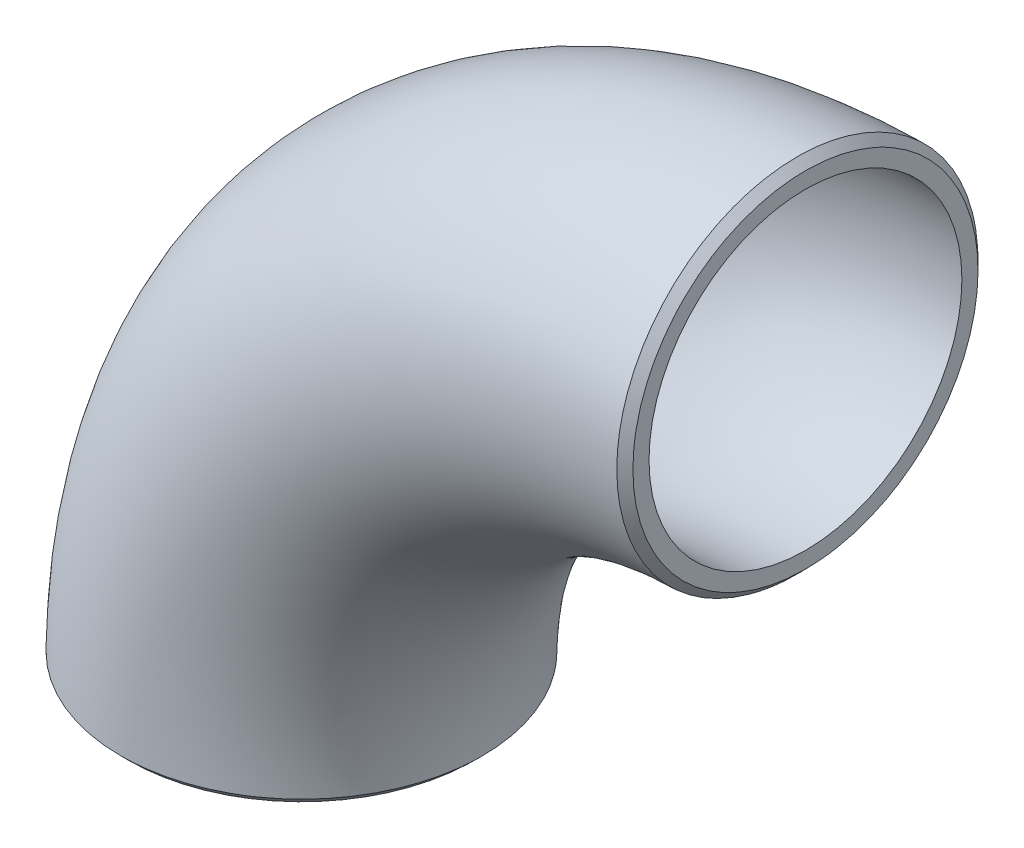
ISO-10303-21;
HEADER;
FILE_DESCRIPTION(('STEP AP214'),'2;1');
FILE_NAME('part.step','',(''),(''),'','','');
FILE_SCHEMA(('AUTOMOTIVE_DESIGN { 1 0 10303 214 1 1 1 1 }'));
ENDSEC;
DATA;
#1=APPLICATION_CONTEXT('core data for automotive mechanical design processes');
#2=APPLICATION_PROTOCOL_DEFINITION('international standard','automotive_design',2000,#1);
#3=PRODUCT_CONTEXT('',#1,'mechanical');
#4=PRODUCT('Part','Part','',(#3));
#5=PRODUCT_RELATED_PRODUCT_CATEGORY('part','',(#4));
#6=PRODUCT_DEFINITION_FORMATION('','',#4);
#7=PRODUCT_DEFINITION_CONTEXT('part definition',#1,'design');
#8=PRODUCT_DEFINITION('design','',#6,#7);
#9=PRODUCT_DEFINITION_SHAPE('','',#8);
#10=(LENGTH_UNIT() NAMED_UNIT(*) SI_UNIT(.MILLI.,.METRE.));
#11=(NAMED_UNIT(*) PLANE_ANGLE_UNIT() SI_UNIT($,.RADIAN.));
#12=(NAMED_UNIT(*) SI_UNIT($,.STERADIAN.) SOLID_ANGLE_UNIT());
#13=UNCERTAINTY_MEASURE_WITH_UNIT(LENGTH_MEASURE(1.E-05),#10,'distance_accuracy_value','');
#14=(GEOMETRIC_REPRESENTATION_CONTEXT(3) GLOBAL_UNCERTAINTY_ASSIGNED_CONTEXT((#13)) GLOBAL_UNIT_ASSIGNED_CONTEXT((#10,
#11,#12)) REPRESENTATION_CONTEXT('',''));
#15=CARTESIAN_POINT('',(0.,0.,0.));
#16=DIRECTION('',(0.,0.,1.));
#17=DIRECTION('',(1.,0.,0.));
#18=AXIS2_PLACEMENT_3D('',#15,#16,#17);
#19=CARTESIAN_POINT('',(0.,0.,0.));
#20=DIRECTION('',(0.,0.,1.));
#21=DIRECTION('',(1.,0.,0.));
#22=AXIS2_PLACEMENT_3D('',#19,#20,#21);
#23=TOROIDAL_SURFACE('',#22,381.,136.5);
#24=CARTESIAN_POINT('',(-6.08756959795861,381.002269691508,136.499990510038));
#25=CARTESIAN_POINT('',(-6.08439914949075,376.550770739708,136.502308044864));
#26=CARTESIAN_POINT('',(-6.08111194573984,372.085039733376,136.286338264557));
#27=CARTESIAN_POINT('',(-6.07426890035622,363.112728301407,135.40469280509));
#28=CARTESIAN_POINT('',(-6.07076228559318,358.671418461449,134.744854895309));
#29=CARTESIAN_POINT('',(-6.06003467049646,345.561969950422,132.1319390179));
#30=CARTESIAN_POINT('',(-6.05256894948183,337.052351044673,129.558449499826));
#31=CARTESIAN_POINT('',(-6.04085751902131,324.632004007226,124.424828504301));
#32=CARTESIAN_POINT('',(-6.03685544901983,320.539518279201,122.49004944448));
#33=CARTESIAN_POINT('',(-6.02885895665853,312.64627992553,118.270209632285));
#34=CARTESIAN_POINT('',(-6.02483922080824,308.817534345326,115.97576059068));
#35=CARTESIAN_POINT('',(-6.01280217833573,297.737084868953,108.572933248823));
#36=CARTESIAN_POINT('',(-6.00473665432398,290.82230618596,102.920875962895));
#37=CARTESIAN_POINT('',(-5.98891855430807,278.064747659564,90.1728805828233));
#38=CARTESIAN_POINT('',(-5.98141785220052,272.418751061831,83.2764197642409));
#39=CARTESIAN_POINT('',(-5.97110204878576,265.00521393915,72.2016533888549));
#40=CARTESIAN_POINT('',(-5.96781368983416,262.706811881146,68.3738626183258));
#41=CARTESIAN_POINT('',(-5.96162770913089,258.473411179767,60.4693178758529));
#42=CARTESIAN_POINT('',(-5.95872759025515,256.537145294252,56.3805099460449));
#43=CARTESIAN_POINT('',(-5.9509034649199,251.40318333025,43.9838975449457));
#44=CARTESIAN_POINT('',(-5.94678213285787,248.820391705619,35.4748421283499));
#45=CARTESIAN_POINT('',(-5.94254549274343,246.196010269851,22.3539678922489));
#46=CARTESIAN_POINT('',(-5.9414605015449,245.531940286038,17.9004052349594));
#47=CARTESIAN_POINT('',(-5.94000986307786,244.646646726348,8.93931574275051));
#48=CARTESIAN_POINT('',(-5.93965028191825,244.428846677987,4.48203937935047));
#49=CARTESIAN_POINT('',(-5.93964699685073,244.426846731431,-4.42095911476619));
#50=CARTESIAN_POINT('',(-5.94000408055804,244.643146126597,-8.86096626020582));
#51=CARTESIAN_POINT('',(-5.94142427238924,245.509802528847,-17.7180250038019));
#52=CARTESIAN_POINT('',(-5.94248629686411,246.159512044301,-22.1308191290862));
#53=CARTESIAN_POINT('',(-5.94530880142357,247.907569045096,-30.9498476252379));
#54=CARTESIAN_POINT('',(-5.9470663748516,249.00456514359,-35.3298764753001));
#55=CARTESIAN_POINT('',(-5.95114752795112,251.594945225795,-43.8703544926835));
#56=CARTESIAN_POINT('',(-5.953481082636,253.094579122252,-48.0636649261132));
#57=CARTESIAN_POINT('',(-5.95866074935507,256.493241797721,-56.278796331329));
#58=CARTESIAN_POINT('',(-5.96151093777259,258.395116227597,-60.3071884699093));
#59=CARTESIAN_POINT('',(-5.96765517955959,262.596785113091,-68.1836619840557));
#60=CARTESIAN_POINT('',(-5.97097872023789,264.917907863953,-72.0629102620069));
#61=CARTESIAN_POINT('',(-5.97792509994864,269.907371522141,-79.5328258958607));
#62=CARTESIAN_POINT('',(-5.98153365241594,272.564659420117,-83.1146309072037));
#63=CARTESIAN_POINT('',(-5.98896840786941,278.207392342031,-89.9942512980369));
#64=CARTESIAN_POINT('',(-5.99279454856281,281.19324099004,-93.2910417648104));
#65=CARTESIAN_POINT('',(-6.0005961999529,287.480586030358,-99.5894126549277));
#66=CARTESIAN_POINT('',(-6.00457661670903,290.78712700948,-102.593069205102));
#67=CARTESIAN_POINT('',(-6.01267261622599,297.748055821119,-108.313313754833));
#68=CARTESIAN_POINT('',(-6.01673784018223,301.3600522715,-110.993283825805));
#69=CARTESIAN_POINT('',(-6.02881935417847,312.481220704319,-118.423741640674));
#70=CARTESIAN_POINT('',(-6.0367792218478,320.318629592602,-122.623218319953));
#71=CARTESIAN_POINT('',(-6.04848574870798,332.716291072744,-127.775336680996));
#72=CARTESIAN_POINT('',(-6.05236572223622,336.97659928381,-129.302606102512));
#73=CARTESIAN_POINT('',(-6.05989797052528,345.549998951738,-131.906214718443));
#74=CARTESIAN_POINT('',(-6.06356839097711,349.880184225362,-132.992742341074));
#75=CARTESIAN_POINT('',(-6.07426289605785,362.949443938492,-135.597308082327));
#76=CARTESIAN_POINT('',(-6.08102671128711,371.823801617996,-136.492696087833));
#77=CARTESIAN_POINT('',(-6.09388342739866,389.859293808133,-136.507215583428));
#78=CARTESIAN_POINT('',(-6.09980598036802,398.773691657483,-135.631796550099));
#79=CARTESIAN_POINT('',(-6.11087971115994,416.464224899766,-132.108711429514));
#80=CARTESIAN_POINT('',(-6.11589253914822,425.020956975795,-129.495732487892));
#81=CARTESIAN_POINT('',(-6.12274939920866,437.331870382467,-124.394604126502));
#82=CARTESIAN_POINT('',(-6.12493285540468,441.36499308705,-122.486770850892));
#83=CARTESIAN_POINT('',(-6.12909726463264,449.247727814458,-118.274682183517));
#84=CARTESIAN_POINT('',(-6.1310964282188,453.13419915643,-115.944474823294));
#85=CARTESIAN_POINT('',(-6.13484158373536,460.582163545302,-110.961139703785));
#86=CARTESIAN_POINT('',(-6.13659810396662,464.162191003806,-108.302015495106));
#87=CARTESIAN_POINT('',(-6.13990322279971,471.035408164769,-102.656924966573));
#88=CARTESIAN_POINT('',(-6.14145302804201,474.331443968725,-99.666929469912));
#89=CARTESIAN_POINT('',(-6.14581663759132,483.777971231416,-90.2271954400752));
#90=CARTESIAN_POINT('',(-6.14837267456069,489.554507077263,-83.1857321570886));
#91=CARTESIAN_POINT('',(-6.15157265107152,496.967748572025,-72.0718326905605));
#92=CARTESIAN_POINT('',(-6.15254501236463,499.25535348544,-68.2548713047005));
#93=CARTESIAN_POINT('',(-6.15430716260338,503.44709915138,-60.4112344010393));
#94=CARTESIAN_POINT('',(-6.15509850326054,505.354690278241,-56.3804244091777));
#95=CARTESIAN_POINT('',(-6.15650865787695,508.783369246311,-48.1074195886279));
#96=CARTESIAN_POINT('',(-6.15712940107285,510.309429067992,-43.8388989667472));
#97=CARTESIAN_POINT('',(-6.15817666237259,512.900050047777,-35.2805408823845));
#98=CARTESIAN_POINT('',(-6.15861054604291,513.982563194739,-30.9512953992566));
#99=CARTESIAN_POINT('',(-6.15964670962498,516.57708448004,-17.8804889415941));
#100=CARTESIAN_POINT('',(-6.15999648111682,517.465745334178,-8.97665068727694));
#101=CARTESIAN_POINT('',(-6.15999502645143,517.462125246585,4.54029182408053));
#102=CARTESIAN_POINT('',(-6.15990688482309,517.238956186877,9.00170535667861));
#103=CARTESIAN_POINT('',(-6.15955938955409,516.362422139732,17.8647537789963));
#104=CARTESIAN_POINT('',(-6.15930005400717,515.709070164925,22.2619741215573));
#105=CARTESIAN_POINT('',(-6.15860694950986,513.973556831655,30.9880240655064));
#106=CARTESIAN_POINT('',(-6.15817334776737,512.891769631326,35.3145816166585));
#107=CARTESIAN_POINT('',(-6.15712024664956,510.286866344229,43.9066360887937));
#108=CARTESIAN_POINT('',(-6.15650045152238,508.763281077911,48.1617816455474));
#109=CARTESIAN_POINT('',(-6.15438678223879,503.624468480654,60.5434394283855));
#110=CARTESIAN_POINT('',(-6.15263584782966,499.430279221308,68.3852963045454));
#111=CARTESIAN_POINT('',(-6.14942668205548,491.996548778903,79.5219447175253));
#112=CARTESIAN_POINT('',(-6.14825125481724,489.310258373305,83.1447452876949));
#113=CARTESIAN_POINT('',(-6.14570752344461,483.601506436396,90.0962939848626));
#114=CARTESIAN_POINT('',(-6.14435015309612,480.60329650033,93.3991966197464));
#115=CARTESIAN_POINT('',(-6.14144218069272,474.307924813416,99.6908410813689));
#116=CARTESIAN_POINT('',(-6.13989311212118,471.014029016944,102.675842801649));
#117=CARTESIAN_POINT('',(-6.13658422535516,464.133685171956,108.324059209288));
#118=CARTESIAN_POINT('',(-6.13482812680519,460.554556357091,110.982255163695));
#119=CARTESIAN_POINT('',(-6.13106164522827,453.065887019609,115.987494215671));
#120=CARTESIAN_POINT('',(-6.12907339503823,449.20199121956,118.300441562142));
#121=CARTESIAN_POINT('',(-6.12491511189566,441.33196329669,122.503095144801));
#122=CARTESIAN_POINT('',(-6.12273494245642,437.305817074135,124.405636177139));
#123=CARTESIAN_POINT('',(-6.11816186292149,429.095432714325,127.807204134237));
#124=CARTESIAN_POINT('',(-6.11576136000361,424.898151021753,129.310265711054));
#125=CARTESIAN_POINT('',(-6.11072473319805,416.3522412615,131.906666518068));
#126=CARTESIAN_POINT('',(-6.10806190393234,411.961234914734,133.007783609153));
#127=CARTESIAN_POINT('',(-6.10255140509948,403.161066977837,134.755724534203));
#128=CARTESIAN_POINT('',(-6.09970387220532,398.749441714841,135.408006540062));
#129=CARTESIAN_POINT('',(-6.09379876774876,389.896386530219,136.279254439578));
#130=CARTESIAN_POINT('',(-6.09074004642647,385.453768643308,136.497672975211));
#131=CARTESIAN_POINT('',(-6.08756959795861,381.002269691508,136.499990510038));
#132=B_SPLINE_CURVE_WITH_KNOTS('',3,(#24,#25,#26,#27,#28,#29,#30,#31,#32,#33,#34,#35,#36,#37,
#38,#39,#40,#41,#42,#43,#44,#45,#46,#47,#48,#49,#50,#51,#52,#53,#54,#55,#56,#57,#58,#59,#60,#61,
#62,#63,#64,#65,#66,#67,#68,#69,#70,#71,#72,#73,#74,#75,#76,#77,#78,#79,#80,#81,#82,#83,#84,#85,
#86,#87,#88,#89,#90,#91,#92,#93,#94,#95,#96,#97,#98,#99,#100,#101,#102,#103,#104,#105,#106,#107,
#108,#109,#110,#111,#112,#113,#114,#115,#116,#117,#118,#119,#120,#121,#122,#123,#124,#125,#126,
#127,#128,#129,#130,#131),.UNSPECIFIED.,.T.,.F.,(4,2,2,2,2,2,2,2,2,2,2,2,2,2,2,2,2,2,2,2,2,2,2,
2,2,2,2,2,2,2,2,2,2,2,2,2,2,2,2,2,2,2,2,2,2,2,2,2,2,2,2,2,2,4),(-0.801689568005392,
-0.788948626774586,-0.776207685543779,-0.750725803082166,-0.737984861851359,-0.725243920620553,
-0.69976203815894,-0.674280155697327,-0.66153921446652,-0.648798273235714,-0.623316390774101,
-0.610575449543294,-0.597834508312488,-0.585093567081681,-0.572352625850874,-0.559611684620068,
-0.546870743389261,-0.534129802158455,-0.521388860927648,-0.508647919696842,-0.495906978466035,
-0.483166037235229,-0.470425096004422,-0.444943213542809,-0.432202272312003,-0.419461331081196,
-0.393979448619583,-0.36849756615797,-0.343015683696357,-0.33027474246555,-0.317533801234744,
-0.304792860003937,-0.292051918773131,-0.266570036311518,-0.253829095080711,-0.241088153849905,
-0.228347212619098,-0.215606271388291,-0.190124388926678,-0.177383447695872,-0.164642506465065,
-0.151901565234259,-0.139160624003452,-0.113678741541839,-0.100937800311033,-0.0881968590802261,
-0.0754559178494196,-0.0627149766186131,-0.0499740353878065,-0.037233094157,-0.0244921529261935,
-0.0117512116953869,0.000989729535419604,0.0137306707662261),.UNSPECIFIED.);
#133=CARTESIAN_POINT('',(-6.08756959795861,381.002269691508,136.499990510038));
#134=VERTEX_POINT('',#133);
#135=EDGE_CURVE('E46',#134,#134,#132,.F.);
#136=ORIENTED_EDGE('',*,*,#135,.T.);
#137=EDGE_LOOP('',(#136));
#138=FACE_BOUND('',#137,.T.);
#139=CARTESIAN_POINT('',(-381.002269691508,6.08756959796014,136.499990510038));
#140=CARTESIAN_POINT('',(-382.348981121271,6.08852902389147,136.4998745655));
#141=CARTESIAN_POINT('',(-383.695600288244,6.08947840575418,136.479319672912));
#142=CARTESIAN_POINT('',(-386.392916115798,6.09136099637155,136.397816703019));
#143=CARTESIAN_POINT('',(-387.743608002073,6.09229412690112,136.336710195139));
#144=CARTESIAN_POINT('',(-391.799171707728,6.095068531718,136.09313035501));
#145=CARTESIAN_POINT('',(-394.500627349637,6.09687990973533,135.85040260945));
#146=CARTESIAN_POINT('',(-399.879695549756,6.10041901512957,135.207124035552));
#147=CARTESIAN_POINT('',(-402.557342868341,6.10214689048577,134.806864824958));
#148=CARTESIAN_POINT('',(-406.544871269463,6.104671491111,134.08666730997));
#149=CARTESIAN_POINT('',(-407.865928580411,6.10549981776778,133.827436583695));
#150=CARTESIAN_POINT('',(-410.49735389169,6.10713482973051,133.270885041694));
#151=CARTESIAN_POINT('',(-411.807737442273,6.10794155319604,132.973637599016));
#152=CARTESIAN_POINT('',(-415.722575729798,6.1103301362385,132.02482630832));
#153=CARTESIAN_POINT('',(-418.313350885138,6.11188207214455,131.315717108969));
#154=CARTESIAN_POINT('',(-423.451715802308,6.11490719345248,129.744353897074));
#155=CARTESIAN_POINT('',(-425.999240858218,6.11638026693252,128.881889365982));
#156=CARTESIAN_POINT('',(-431.051104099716,6.1192534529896,127.004053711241));
#157=CARTESIAN_POINT('',(-433.555184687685,6.12065319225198,125.987986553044));
#158=CARTESIAN_POINT('',(-437.269178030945,6.12269615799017,124.350350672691));
#159=CARTESIAN_POINT('',(-438.503603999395,6.12336953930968,123.783775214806));
#160=CARTESIAN_POINT('',(-440.954649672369,6.12469609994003,122.614642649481));
#161=CARTESIAN_POINT('',(-442.17127657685,6.1253492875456,122.01210062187));
#162=CARTESIAN_POINT('',(-445.779532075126,6.12727143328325,120.157127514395));
#163=CARTESIAN_POINT('',(-448.143932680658,6.12851087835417,118.851005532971));
#164=CARTESIAN_POINT('',(-451.625048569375,6.13030956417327,116.791715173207));
#165=CARTESIAN_POINT('',(-452.772554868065,6.13089806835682,116.089915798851));
#166=CARTESIAN_POINT('',(-455.04368779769,6.13205447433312,114.65394077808));
#167=CARTESIAN_POINT('',(-456.167360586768,6.13262241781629,113.919838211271));
#168=CARTESIAN_POINT('',(-459.505161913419,6.13429788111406,111.66860182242));
#169=CARTESIAN_POINT('',(-461.686426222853,6.13537721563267,110.102330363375));
#170=CARTESIAN_POINT('',(-465.959309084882,6.13746440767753,106.839121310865));
#171=CARTESIAN_POINT('',(-468.050633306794,6.13847203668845,105.141799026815));
#172=CARTESIAN_POINT('',(-472.140058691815,6.14041842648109,101.616406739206));
#173=CARTESIAN_POINT('',(-474.137587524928,6.14135678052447,99.7876724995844));
#174=CARTESIAN_POINT('',(-478.026080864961,6.14316294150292,96.0099091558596));
#175=CARTESIAN_POINT('',(-479.916738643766,6.14403054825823,94.0605644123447));
#176=CARTESIAN_POINT('',(-483.56573549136,6.14568748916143,90.0664722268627));
#177=CARTESIAN_POINT('',(-485.324901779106,6.14647732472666,88.0224807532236));
#178=CARTESIAN_POINT('',(-488.711446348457,6.14798286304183,83.8420105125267));
#179=CARTESIAN_POINT('',(-490.339336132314,6.1486988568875,81.7059459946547));
#180=CARTESIAN_POINT('',(-493.46671864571,6.15006255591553,77.3432932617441));
#181=CARTESIAN_POINT('',(-494.96626817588,6.15071029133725,75.1167457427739));
#182=CARTESIAN_POINT('',(-497.837208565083,6.15194054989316,70.5679105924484));
#183=CARTESIAN_POINT('',(-499.207976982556,6.15252275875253,68.2452290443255));
#184=CARTESIAN_POINT('',(-501.162805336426,6.15334719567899,64.6984154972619));
#185=CARTESIAN_POINT('',(-501.798952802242,6.1536144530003,63.502688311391));
#186=CARTESIAN_POINT('',(-503.036739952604,6.15413267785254,61.0897347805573));
#187=CARTESIAN_POINT('',(-503.638290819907,6.15438360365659,59.8724627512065));
#188=CARTESIAN_POINT('',(-504.804714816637,6.15486858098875,57.4213630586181));
#189=CARTESIAN_POINT('',(-505.369609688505,6.15510264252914,56.1875457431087));
#190=CARTESIAN_POINT('',(-506.459911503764,6.15555301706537,53.7080685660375));
#191=CARTESIAN_POINT('',(-506.98545657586,6.1557693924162,52.4624692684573));
#192=CARTESIAN_POINT('',(-508.501889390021,6.15639209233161,48.7146145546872));
#193=CARTESIAN_POINT('',(-509.437983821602,6.15677423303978,46.1899138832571));
#194=CARTESIAN_POINT('',(-511.15696306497,6.15747274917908,41.0961300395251));
#195=CARTESIAN_POINT('',(-511.940225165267,6.1577892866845,38.5271736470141));
#196=CARTESIAN_POINT('',(-513.354299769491,6.15835856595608,33.345023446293));
#197=CARTESIAN_POINT('',(-513.984978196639,6.15861125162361,30.7317928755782));
#198=CARTESIAN_POINT('',(-514.816306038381,6.158943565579,26.7837661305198));
#199=CARTESIAN_POINT('',(-515.07462993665,6.15904668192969,25.4608635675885));
#200=CARTESIAN_POINT('',(-515.552447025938,6.15923717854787,22.8025557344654));
#201=CARTESIAN_POINT('',(-515.771779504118,6.15932449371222,21.4671215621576));
#202=CARTESIAN_POINT('',(-516.371425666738,6.15956296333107,17.4432665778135));
#203=CARTESIAN_POINT('',(-516.691631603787,6.15968994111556,14.7456411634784));
#204=CARTESIAN_POINT('',(-517.169456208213,6.15987927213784,9.35062251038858));
#205=CARTESIAN_POINT('',(-517.327928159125,6.15994196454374,6.6533039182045));
#206=CARTESIAN_POINT('',(-517.484057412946,6.16000373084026,1.26724477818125));
#207=CARTESIAN_POINT('',(-517.482501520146,6.16000311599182,-1.42147274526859));
#208=CARTESIAN_POINT('',(-517.320754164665,6.15993912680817,-6.79096006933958));
#209=CARTESIAN_POINT('',(-517.160748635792,6.15987582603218,-9.47173549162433));
#210=CARTESIAN_POINT('',(-516.682583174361,6.15968635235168,-14.8244549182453));
#211=CARTESIAN_POINT('',(-516.364113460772,6.15956005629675,-17.4963712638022));
#212=CARTESIAN_POINT('',(-515.567235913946,6.15924315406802,-22.8333688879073));
#213=CARTESIAN_POINT('',(-515.087838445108,6.15905214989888,-25.4983024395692));
#214=CARTESIAN_POINT('',(-513.970051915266,6.15860521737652,-30.8018608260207));
#215=CARTESIAN_POINT('',(-513.33125233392,6.15834912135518,-33.4403991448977));
#216=CARTESIAN_POINT('',(-511.902159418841,6.15777360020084,-38.6576857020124));
#217=CARTESIAN_POINT('',(-511.112877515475,6.15745459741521,-41.2367110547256));
#218=CARTESIAN_POINT('',(-509.386192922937,6.15675296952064,-46.3343869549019));
#219=CARTESIAN_POINT('',(-508.449331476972,6.15637057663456,-48.8532208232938));
#220=CARTESIAN_POINT('',(-506.428602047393,6.15554066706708,-53.8306367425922));
#221=CARTESIAN_POINT('',(-505.344762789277,6.15509316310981,-56.2892304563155));
#222=CARTESIAN_POINT('',(-503.030901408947,6.15413100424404,-61.1452159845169));
#223=CARTESIAN_POINT('',(-501.800472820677,6.15361616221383,-63.5424141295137));
#224=CARTESIAN_POINT('',(-499.190459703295,6.15251534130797,-68.2764340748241));
#225=CARTESIAN_POINT('',(-497.80987764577,6.15192888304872,-70.6127059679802));
#226=CARTESIAN_POINT('',(-494.91417824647,6.15068784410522,-75.1957360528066));
#227=CARTESIAN_POINT('',(-493.399252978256,6.15003336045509,-77.4426155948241));
#228=CARTESIAN_POINT('',(-490.248491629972,6.14865882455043,-81.8281273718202));
#229=CARTESIAN_POINT('',(-488.613490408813,6.14793921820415,-83.9673597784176));
#230=CARTESIAN_POINT('',(-485.223716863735,6.14643154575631,-88.1405052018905));
#231=CARTESIAN_POINT('',(-483.469238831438,6.14564364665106,-90.1746567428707));
#232=CARTESIAN_POINT('',(-480.750083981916,6.14440862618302,-93.1454146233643));
#233=CARTESIAN_POINT('',(-479.829065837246,6.14398806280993,-94.1223141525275));
#234=CARTESIAN_POINT('',(-477.958018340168,6.1431288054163,-96.0495333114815));
#235=CARTESIAN_POINT('',(-477.007965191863,6.14269009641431,-96.9998298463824));
#236=CARTESIAN_POINT('',(-474.108377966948,6.14134309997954,-99.8152476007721));
#237=CARTESIAN_POINT('',(-472.116534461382,6.14040716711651,-101.637111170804));
#238=CARTESIAN_POINT('',(-468.015098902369,6.13845483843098,-105.171296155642));
#239=CARTESIAN_POINT('',(-465.904820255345,6.13743795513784,-106.882820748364));
#240=CARTESIAN_POINT('',(-462.669129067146,6.13585707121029,-109.351165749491));
#241=CARTESIAN_POINT('',(-461.580376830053,6.13532161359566,-110.156431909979));
#242=CARTESIAN_POINT('',(-459.383174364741,6.13423336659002,-111.731180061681));
#243=CARTESIAN_POINT('',(-458.274809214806,6.13368064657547,-112.500780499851));
#244=CARTESIAN_POINT('',(-456.039340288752,6.13255783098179,-114.004126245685));
#245=CARTESIAN_POINT('',(-454.912310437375,6.13198779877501,-114.737981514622));
#246=CARTESIAN_POINT('',(-452.639029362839,6.1308296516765,-116.171340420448));
#247=CARTESIAN_POINT('',(-451.492809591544,6.13024156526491,-116.870894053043));
#248=CARTESIAN_POINT('',(-448.025131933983,6.1284489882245,-118.917635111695));
#249=CARTESIAN_POINT('',(-445.673291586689,6.12721549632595,-120.213820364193));
#250=CARTESIAN_POINT('',(-440.891691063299,6.12466719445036,-122.667489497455));
#251=CARTESIAN_POINT('',(-438.461767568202,6.12335220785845,-123.824654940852));
#252=CARTESIAN_POINT('',(-434.764573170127,6.12131829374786,-125.454163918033));
#253=CARTESIAN_POINT('',(-433.520899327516,6.12062863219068,-125.980579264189));
#254=CARTESIAN_POINT('',(-431.013218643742,6.11922613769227,-126.997972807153));
#255=CARTESIAN_POINT('',(-429.749149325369,6.11851322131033,-127.4887967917));
#256=CARTESIAN_POINT('',(-425.93430766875,6.11634310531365,-128.905206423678));
#257=CARTESIAN_POINT('',(-423.362142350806,6.11485522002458,-129.774183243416));
#258=CARTESIAN_POINT('',(-419.474899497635,6.11256552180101,-130.959252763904));
#259=CARTESIAN_POINT('',(-418.177278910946,6.1117944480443,-131.33383071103));
#260=CARTESIAN_POINT('',(-415.574842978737,6.11023402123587,-132.043673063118));
#261=CARTESIAN_POINT('',(-414.270054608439,6.10944472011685,-132.379035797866));
#262=CARTESIAN_POINT('',(-411.654292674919,6.10784771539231,-133.010086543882));
#263=CARTESIAN_POINT('',(-410.343342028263,6.10704006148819,-133.305869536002));
#264=CARTESIAN_POINT('',(-407.715736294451,6.10540596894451,-133.857766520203));
#265=CARTESIAN_POINT('',(-406.399096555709,6.10457956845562,-134.11395401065));
#266=CARTESIAN_POINT('',(-402.437014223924,6.10206934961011,-134.824997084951));
#267=CARTESIAN_POINT('',(-399.780926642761,6.10035543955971,-135.221968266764));
#268=CARTESIAN_POINT('',(-394.440739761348,6.09684141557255,-135.85931553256));
#269=CARTESIAN_POINT('',(-391.756574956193,6.09504102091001,-136.099138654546));
#270=CARTESIAN_POINT('',(-386.361379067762,6.09134873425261,-136.420040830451));
#271=CARTESIAN_POINT('',(-383.650286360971,6.08945632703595,-136.500086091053));
#272=CARTESIAN_POINT('',(-378.224405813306,6.08559036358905,-136.499912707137));
#273=CARTESIAN_POINT('',(-375.509618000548,6.08361669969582,-136.419474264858));
#274=CARTESIAN_POINT('',(-370.097276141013,6.07959814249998,-136.096792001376));
#275=CARTESIAN_POINT('',(-367.399695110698,6.07755346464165,-135.855002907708));
#276=CARTESIAN_POINT('',(-362.019793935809,6.07338791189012,-135.209835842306));
#277=CARTESIAN_POINT('',(-359.337503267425,6.07126692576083,-134.806212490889));
#278=CARTESIAN_POINT('',(-353.995823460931,6.06695146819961,-133.840100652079));
#279=CARTESIAN_POINT('',(-351.33649493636,6.0647568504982,-133.277277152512));
#280=CARTESIAN_POINT('',(-346.071503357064,6.06031620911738,-131.997538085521));
#281=CARTESIAN_POINT('',(-343.465618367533,6.05807055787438,-131.281536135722));
#282=CARTESIAN_POINT('',(-338.312561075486,6.05353314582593,-129.699372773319));
#283=CARTESIAN_POINT('',(-335.765178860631,6.05124163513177,-128.833894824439));
#284=CARTESIAN_POINT('',(-330.731068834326,6.04661475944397,-126.956656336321));
#285=CARTESIAN_POINT('',(-328.244224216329,6.04427949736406,-125.945208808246));
#286=CARTESIAN_POINT('',(-323.327832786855,6.03956219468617,-123.773782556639));
#287=CARTESIAN_POINT('',(-320.898463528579,6.03718004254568,-122.613400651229));
#288=CARTESIAN_POINT('',(-317.305089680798,6.03358133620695,-120.765493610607));
#289=CARTESIAN_POINT('',(-316.113800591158,6.03237548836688,-120.130486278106));
#290=CARTESIAN_POINT('',(-313.745104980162,6.02995195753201,-118.821979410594));
#291=CARTESIAN_POINT('',(-312.567792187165,6.02873424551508,-118.148310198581));
#292=CARTESIAN_POINT('',(-309.065983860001,6.02507396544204,-116.07507874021));
#293=CARTESIAN_POINT('',(-306.77200073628,6.0226246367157,-114.623489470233));
#294=CARTESIAN_POINT('',(-302.289552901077,6.01773784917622,-111.595794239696));
#295=CARTESIAN_POINT('',(-300.100500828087,6.01530041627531,-110.020555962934));
#296=CARTESIAN_POINT('',(-295.827057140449,6.01044566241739,-106.749301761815));
#297=CARTESIAN_POINT('',(-293.742317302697,6.00802830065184,-105.053740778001));
#298=CARTESIAN_POINT('',(-289.677290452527,6.00322191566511,-101.54246139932));
#299=CARTESIAN_POINT('',(-287.696978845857,6.00083288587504,-99.7267715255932));
#300=CARTESIAN_POINT('',(-284.807123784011,5.99728152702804,-96.9178537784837));
#301=CARTESIAN_POINT('',(-283.856534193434,5.99610215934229,-95.9665091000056));
#302=CARTESIAN_POINT('',(-281.980814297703,5.99375277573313,-94.0316331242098));
#303=CARTESIAN_POINT('',(-281.055801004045,5.99258281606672,-93.0479883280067));
#304=CARTESIAN_POINT('',(-278.318569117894,5.98908934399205,-90.0493841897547));
#305=CARTESIAN_POINT('',(-276.550993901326,5.98679066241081,-87.9934040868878));
#306=CARTESIAN_POINT('',(-273.140661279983,5.98228101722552,-83.7823914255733));
#307=CARTESIAN_POINT('',(-271.497830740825,5.98007000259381,-81.6274181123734));
#308=CARTESIAN_POINT('',(-269.1363626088,5.97684020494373,-78.3291823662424));
#309=CARTESIAN_POINT('',(-268.367922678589,5.97578030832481,-77.2213295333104));
#310=CARTESIAN_POINT('',(-266.867159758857,5.97369378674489,-74.9867090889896));
#311=CARTESIAN_POINT('',(-266.134726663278,5.97266706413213,-73.8600153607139));
#312=CARTESIAN_POINT('',(-263.988453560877,5.96963639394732,-70.4506248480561));
#313=CARTESIAN_POINT('',(-262.624105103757,5.96767983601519,-68.136469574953));
#314=CARTESIAN_POINT('',(-260.03421053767,5.96391565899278,-63.429715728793));
#315=CARTESIAN_POINT('',(-258.808769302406,5.96210815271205,-61.0370596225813));
#316=CARTESIAN_POINT('',(-256.49582691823,5.95865588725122,-56.1733380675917));
#317=CARTESIAN_POINT('',(-255.408930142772,5.95701184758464,-53.7019841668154));
#318=CARTESIAN_POINT('',(-253.887720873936,5.95468671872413,-49.9429711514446));
#319=CARTESIAN_POINT('',(-253.39760119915,5.95393322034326,-48.6776228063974));
#320=CARTESIAN_POINT('',(-252.454559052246,5.95247612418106,-46.1314689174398));
#321=CARTESIAN_POINT('',(-252.001679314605,5.95177258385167,-44.8506474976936));
#322=CARTESIAN_POINT('',(-251.135640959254,5.95042092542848,-42.2801103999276));
#323=CARTESIAN_POINT('',(-250.722362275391,5.94977264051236,-40.9904351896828));
#324=CARTESIAN_POINT('',(-249.936308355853,5.94853447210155,-38.4048166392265));
#325=CARTESIAN_POINT('',(-249.563368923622,5.94794435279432,-37.1089230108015));
#326=CARTESIAN_POINT('',(-248.504107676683,5.94626182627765,-33.2129413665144));
#327=CARTESIAN_POINT('',(-247.87482926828,5.94525331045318,-30.5970755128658));
#328=CARTESIAN_POINT('',(-246.77371943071,5.94347967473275,-25.3378074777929));
#329=CARTESIAN_POINT('',(-246.301589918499,5.94271409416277,-22.6944673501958));
#330=CARTESIAN_POINT('',(-245.512272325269,5.94142994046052,-17.3769656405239));
#331=CARTESIAN_POINT('',(-245.1955323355,5.94091208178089,-14.7027374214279));
#332=CARTESIAN_POINT('',(-244.720027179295,5.9401318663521,-9.32820825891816));
#333=CARTESIAN_POINT('',(-244.5619754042,5.93987066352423,-6.6278441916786));
#334=CARTESIAN_POINT('',(-244.406162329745,5.93961312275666,-1.21225254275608));
#335=CARTESIAN_POINT('',(-244.409010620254,5.93961779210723,1.50299258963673));
#336=CARTESIAN_POINT('',(-244.576177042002,5.93989286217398,6.91071544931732));
#337=CARTESIAN_POINT('',(-244.739438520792,5.94016152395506,9.6032258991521));
#338=CARTESIAN_POINT('',(-245.224119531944,5.94095639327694,14.9638065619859));
#339=CARTESIAN_POINT('',(-245.544944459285,5.94148163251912,17.6319305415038));
#340=CARTESIAN_POINT('',(-246.34343740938,5.94278153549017,22.9432834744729));
#341=CARTESIAN_POINT('',(-246.821029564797,5.94355607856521,25.5865238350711));
#342=CARTESIAN_POINT('',(-247.93283749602,5.9453465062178,30.8478385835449));
#343=CARTESIAN_POINT('',(-248.567501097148,5.9463630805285,33.4658183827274));
#344=CARTESIAN_POINT('',(-249.995256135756,5.94862976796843,38.6765118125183));
#345=CARTESIAN_POINT('',(-250.789353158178,5.94988135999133,41.268949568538));
#346=CARTESIAN_POINT('',(-252.530437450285,5.95259681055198,46.4030178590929));
#347=CARTESIAN_POINT('',(-253.477469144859,5.9540607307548,48.9446333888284));
#348=CARTESIAN_POINT('',(-255.008251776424,5.95639876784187,52.7036501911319));
#349=CARTESIAN_POINT('',(-255.535286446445,5.957199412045,53.9444163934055));
#350=CARTESIAN_POINT('',(-256.62423075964,5.95884352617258,56.4070920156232));
#351=CARTESIAN_POINT('',(-257.186056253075,5.95968689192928,57.6290386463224));
#352=CARTESIAN_POINT('',(-258.923334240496,5.96227780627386,61.2649631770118));
#353=CARTESIAN_POINT('',(-260.152434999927,5.96408900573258,63.653560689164));
#354=CARTESIAN_POINT('',(-262.750446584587,5.96786165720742,68.354973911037));
#355=CARTESIAN_POINT('',(-264.119425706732,5.96982318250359,70.6677518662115));
#356=CARTESIAN_POINT('',(-266.274208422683,5.97286291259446,74.0764356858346));
#357=CARTESIAN_POINT('',(-267.010363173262,5.97389377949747,75.2039884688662));
#358=CARTESIAN_POINT('',(-268.518912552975,5.97598911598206,77.4410489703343));
#359=CARTESIAN_POINT('',(-269.291438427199,5.97705370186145,78.5504681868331));
#360=CARTESIAN_POINT('',(-271.664150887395,5.98029612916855,81.8519744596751));
#361=CARTESIAN_POINT('',(-273.314009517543,5.98251490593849,84.0086649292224));
#362=CARTESIAN_POINT('',(-276.732893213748,5.98703054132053,88.212407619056));
#363=CARTESIAN_POINT('',(-278.501471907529,5.98932709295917,90.2598237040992));
#364=CARTESIAN_POINT('',(-282.146675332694,5.99397209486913,94.234359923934));
#365=CARTESIAN_POINT('',(-284.022614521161,5.99632016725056,96.1621084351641));
#366=CARTESIAN_POINT('',(-287.8818129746,6.00105750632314,99.9004450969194));
#367=CARTESIAN_POINT('',(-289.864891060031,6.00344669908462,101.711220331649));
#368=CARTESIAN_POINT('',(-293.937104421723,6.00825555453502,105.215219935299));
#369=CARTESIAN_POINT('',(-296.026382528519,6.01067525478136,106.908278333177));
#370=CARTESIAN_POINT('',(-300.313382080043,6.01553908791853,110.177092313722));
#371=CARTESIAN_POINT('',(-302.511646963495,6.01798328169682,111.752135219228));
#372=CARTESIAN_POINT('',(-307.007808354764,6.02287809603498,114.77584893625));
#373=CARTESIAN_POINT('',(-309.306108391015,6.02532869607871,116.223919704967));
#374=CARTESIAN_POINT('',(-313.970726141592,6.03019684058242,118.972055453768));
#375=CARTESIAN_POINT('',(-316.336544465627,6.03261449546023,120.272967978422));
#376=CARTESIAN_POINT('',(-321.130712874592,6.03740928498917,122.72693534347));
#377=CARTESIAN_POINT('',(-323.558748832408,6.03978654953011,123.880604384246));
#378=CARTESIAN_POINT('',(-328.47651542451,6.04449894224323,126.041888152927));
#379=CARTESIAN_POINT('',(-330.96618758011,6.04683410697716,127.049635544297));
#380=CARTESIAN_POINT('',(-334.744206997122,6.05030210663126,128.450347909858));
#381=CARTESIAN_POINT('',(-336.012098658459,6.0514534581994,128.899163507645));
#382=CARTESIAN_POINT('',(-338.562580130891,6.0537448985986,129.760061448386));
#383=CARTESIAN_POINT('',(-339.845190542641,6.05488496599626,130.172082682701));
#384=CARTESIAN_POINT('',(-343.72550149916,6.05829682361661,131.355162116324));
#385=CARTESIAN_POINT('',(-346.341336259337,6.06054709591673,132.067908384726));
#386=CARTESIAN_POINT('',(-350.295526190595,6.06387698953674,133.020656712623));
#387=CARTESIAN_POINT('',(-351.620156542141,6.06498057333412,133.319111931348));
#388=CARTESIAN_POINT('',(-354.273440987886,6.06716729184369,133.875172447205));
#389=CARTESIAN_POINT('',(-355.602067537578,6.06825048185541,134.132908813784));
#390=CARTESIAN_POINT('',(-359.585719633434,6.07146399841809,134.844608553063));
#391=CARTESIAN_POINT('',(-362.251398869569,6.07356910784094,135.240158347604));
#392=CARTESIAN_POINT('',(-367.593482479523,6.07770057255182,135.871536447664));
#393=CARTESIAN_POINT('',(-370.269830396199,6.07972714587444,136.107842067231));
#394=CARTESIAN_POINT('',(-374.290765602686,6.08271033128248,136.343537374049));
#395=CARTESIAN_POINT('',(-375.632098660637,6.08369524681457,136.40230864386));
#396=CARTESIAN_POINT('',(-378.316356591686,6.08564647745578,136.480565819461));
#397=CARTESIAN_POINT('',(-379.659281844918,6.08661278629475,136.500038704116));
#398=CARTESIAN_POINT('',(-381.002269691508,6.08756959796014,136.499990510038));
#399=B_SPLINE_CURVE_WITH_KNOTS('',3,(#139,#140,#141,#142,#143,#144,#145,#146,#147,#148,#149,
#150,#151,#152,#153,#154,#155,#156,#157,#158,#159,#160,#161,#162,#163,#164,#165,#166,#167,#168,
#169,#170,#171,#172,#173,#174,#175,#176,#177,#178,#179,#180,#181,#182,#183,#184,#185,#186,#187,
#188,#189,#190,#191,#192,#193,#194,#195,#196,#197,#198,#199,#200,#201,#202,#203,#204,#205,#206,
#207,#208,#209,#210,#211,#212,#213,#214,#215,#216,#217,#218,#219,#220,#221,#222,#223,#224,#225,
#226,#227,#228,#229,#230,#231,#232,#233,#234,#235,#236,#237,#238,#239,#240,#241,#242,#243,#244,
#245,#246,#247,#248,#249,#250,#251,#252,#253,#254,#255,#256,#257,#258,#259,#260,#261,#262,#263,
#264,#265,#266,#267,#268,#269,#270,#271,#272,#273,#274,#275,#276,#277,#278,#279,#280,#281,#282,
#283,#284,#285,#286,#287,#288,#289,#290,#291,#292,#293,#294,#295,#296,#297,#298,#299,#300,#301,
#302,#303,#304,#305,#306,#307,#308,#309,#310,#311,#312,#313,#314,#315,#316,#317,#318,#319,#320,
#321,#322,#323,#324,#325,#326,#327,#328,#329,#330,#331,#332,#333,#334,#335,#336,#337,#338,#339,
#340,#341,#342,#343,#344,#345,#346,#347,#348,#349,#350,#351,#352,#353,#354,#355,#356,#357,#358,
#359,#360,#361,#362,#363,#364,#365,#366,#367,#368,#369,#370,#371,#372,#373,#374,#375,#376,#377,
#378,#379,#380,#381,#382,#383,#384,#385,#386,#387,#388,#389,#390,#391,#392,#393,#394,#395,#396,
#397,#398),.UNSPECIFIED.,.F.,.F.,(4,2,2,2,2,2,2,2,2,2,2,2,2,2,2,2,2,2,2,2,2,2,2,2,2,2,2,2,2,2,2,
2,2,2,2,2,2,2,2,2,2,2,2,2,2,2,2,2,2,2,2,2,2,2,2,2,2,2,2,2,2,2,2,2,2,2,2,2,2,2,2,2,2,2,2,2,2,2,2,
2,2,2,2,2,2,2,2,2,2,2,2,2,2,2,2,2,2,2,2,2,2,2,2,2,2,2,2,2,2,2,2,2,2,2,2,2,2,2,2,2,2,2,2,2,2,2,2,
2,2,4),(0.,4.03981030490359,8.09549734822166,16.2275505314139,24.3446201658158,28.3828400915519,
32.4133805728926,40.4664473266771,48.5306554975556,56.6325663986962,60.7067582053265,
64.7792536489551,72.8771187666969,76.9119520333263,80.9380845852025,88.9891214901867,
97.0647625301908,105.184565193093,113.326598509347,121.412127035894,129.464453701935,
137.513197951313,145.599033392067,149.661798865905,153.734567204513,157.804897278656,
161.860195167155,169.933026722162,177.985669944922,186.045363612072,190.08851826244,
194.147969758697,202.292423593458,210.393682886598,218.455112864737,226.507094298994,
234.574878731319,242.693214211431,250.832677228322,258.9192474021,266.976822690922,
275.032825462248,283.111710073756,291.247988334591,299.372815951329,307.445703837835,
315.499379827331,319.526720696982,323.557455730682,331.650522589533,339.796669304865,
343.858741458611,347.906181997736,351.94026331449,355.968278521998,364.019384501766,
372.088594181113,376.13954724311,380.207116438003,388.346315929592,392.397678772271,
396.438654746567,400.469752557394,404.493275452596,412.54499826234,420.624902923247,
428.756918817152,436.900079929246,445.020387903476,453.153055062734,461.30296513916,
469.405557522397,477.472037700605,485.521470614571,493.593172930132,497.64255528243,
501.711317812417,509.850130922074,517.936212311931,525.993200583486,534.048282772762,
538.082388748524,542.132626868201,550.261663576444,558.38589705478,562.430167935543,
566.461185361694,574.515309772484,582.575475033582,590.669678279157,594.740042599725,
598.815014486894,602.87721228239,606.922198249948,614.988541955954,623.039496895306,
631.113533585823,639.223707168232,647.364609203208,655.452243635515,663.509589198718,
671.563041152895,679.639724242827,687.76904661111,695.90073466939,699.944406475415,
703.978653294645,712.03248049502,720.090259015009,724.129509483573,728.184659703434,
736.325590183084,744.437462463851,752.502324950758,760.553951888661,768.616709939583,
776.724778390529,784.869302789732,792.964233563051,801.024210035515,809.076812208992,
813.111254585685,817.152277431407,825.280161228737,829.35319659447,833.412841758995,
841.492451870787,849.547735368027,853.575092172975,857.603783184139),.UNSPECIFIED.);
#400=CARTESIAN_POINT('',(-381.002269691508,6.08756959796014,136.499990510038));
#401=VERTEX_POINT('',#400);
#402=EDGE_CURVE('E51',#401,#401,#399,.F.);
#403=ORIENTED_EDGE('',*,*,#402,.T.);
#404=EDGE_LOOP('',(#403));
#405=FACE_BOUND('',#404,.T.);
#406=ADVANCED_FACE('F34',(#138,#405),#23,.T.);
#407=CARTESIAN_POINT('',(1.2456553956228E-12,381.,0.));
#408=DIRECTION('',(1.,0.,0.));
#409=DIRECTION('',(0.,0.,1.));
#410=AXIS2_PLACEMENT_3D('',#407,#408,#409);
#411=PLANE('',#410);
#412=CARTESIAN_POINT('',(1.52315726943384E-12,381.,130.412457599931));
#413=CARTESIAN_POINT('',(1.53162745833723E-12,383.565819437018,130.411377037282));
#414=CARTESIAN_POINT('',(1.54008870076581E-12,386.131548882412,130.334649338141));
#415=CARTESIAN_POINT('',(1.55701230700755E-12,391.253865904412,130.030201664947));
#416=CARTESIAN_POINT('',(1.56547467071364E-12,393.810454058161,129.80249139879));
#417=CARTESIAN_POINT('',(1.58244751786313E-12,398.913947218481,129.195418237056));
#418=CARTESIAN_POINT('',(1.59095806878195E-12,401.460795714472,128.815576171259));
#419=CARTESIAN_POINT('',(1.60357846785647E-12,405.266903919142,128.132617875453));
#420=CARTESIAN_POINT('',(1.60777137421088E-12,406.536415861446,127.885334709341));
#421=CARTESIAN_POINT('',(1.61610877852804E-12,409.07138231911,127.352046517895));
#422=CARTESIAN_POINT('',(1.6202530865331E-12,410.336812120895,127.065924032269));
#423=CARTESIAN_POINT('',(1.63267055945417E-12,414.113631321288,126.152813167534));
#424=CARTESIAN_POINT('',(1.64094837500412E-12,416.61176004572,125.469964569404));
#425=CARTESIAN_POINT('',(1.65726031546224E-12,421.546560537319,123.961496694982));
#426=CARTESIAN_POINT('',(1.6652956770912E-12,423.98352675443,123.136837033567));
#427=CARTESIAN_POINT('',(1.68102471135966E-12,428.79815974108,121.347309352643));
#428=CARTESIAN_POINT('',(1.68871922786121E-12,431.175965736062,120.382816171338));
#429=CARTESIAN_POINT('',(1.70396498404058E-12,435.872928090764,118.314291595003));
#430=CARTESIAN_POINT('',(1.71151607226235E-12,438.192023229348,117.210121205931));
#431=CARTESIAN_POINT('',(1.72655095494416E-12,442.771103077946,114.861653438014));
#432=CARTESIAN_POINT('',(1.73403430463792E-12,445.03078132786,113.616758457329));
#433=CARTESIAN_POINT('',(1.74882948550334E-12,449.485719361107,110.987306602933));
#434=CARTESIAN_POINT('',(1.75614001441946E-12,451.680509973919,109.601954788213));
#435=CARTESIAN_POINT('',(1.77053806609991E-12,455.973560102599,106.709707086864));
#436=CARTESIAN_POINT('',(1.77762647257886E-12,458.072223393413,105.203410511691));
#437=CARTESIAN_POINT('',(1.79109343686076E-12,462.16501103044,102.077358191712));
#438=CARTESIAN_POINT('',(1.79747568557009E-12,464.159647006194,100.458272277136));
#439=CARTESIAN_POINT('',(1.80995442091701E-12,468.047384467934,97.1074062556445));
#440=CARTESIAN_POINT('',(1.81605126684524E-12,469.940614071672,95.3757747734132));
#441=CARTESIAN_POINT('',(1.82814394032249E-12,473.624918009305,91.8008842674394));
#442=CARTESIAN_POINT('',(1.83413957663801E-12,475.415811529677,89.9574388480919));
#443=CARTESIAN_POINT('',(1.8458815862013E-12,478.895748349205,86.1566146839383));
#444=CARTESIAN_POINT('',(1.85162626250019E-12,480.584121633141,84.1986228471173));
#445=CARTESIAN_POINT('',(1.86245525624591E-12,483.847327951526,80.1791755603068));
#446=CARTESIAN_POINT('',(1.86753731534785E-12,485.421764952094,78.1173978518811));
#447=CARTESIAN_POINT('',(1.8749713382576E-12,487.685679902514,74.9614657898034));
#448=CARTESIAN_POINT('',(1.87741318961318E-12,488.422666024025,73.9011040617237));
#449=CARTESIAN_POINT('',(1.88228623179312E-12,489.861813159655,71.7629487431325));
#450=CARTESIAN_POINT('',(1.88471742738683E-12,490.56409760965,70.6852382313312));
#451=CARTESIAN_POINT('',(1.89171237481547E-12,492.619771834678,67.4271146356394));
#452=CARTESIAN_POINT('',(1.89599097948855E-12,493.925705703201,65.2165098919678));
#453=CARTESIAN_POINT('',(1.90402118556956E-12,496.40396762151,60.7226852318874));
#454=CARTESIAN_POINT('',(1.90777298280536E-12,497.576345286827,58.4394926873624));
#455=CARTESIAN_POINT('',(1.91305421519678E-12,499.233278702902,54.9640122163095));
#456=CARTESIAN_POINT('',(1.91475834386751E-12,499.769114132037,53.7959299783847));
#457=CARTESIAN_POINT('',(1.91806394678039E-12,500.807632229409,51.4417656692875));
#458=CARTESIAN_POINT('',(1.91966516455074E-12,501.310232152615,50.2556470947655));
#459=CARTESIAN_POINT('',(1.92438839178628E-12,502.769874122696,46.6623440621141));
#460=CARTESIAN_POINT('',(1.92741148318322E-12,503.672704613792,44.2328816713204));
#461=CARTESIAN_POINT('',(1.93270956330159E-12,505.331819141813,39.3263874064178));
#462=CARTESIAN_POINT('',(1.93498503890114E-12,506.088198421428,36.8493876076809));
#463=CARTESIAN_POINT('',(1.93956097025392E-12,507.447811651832,31.870628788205));
#464=CARTESIAN_POINT('',(1.94186117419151E-12,508.051991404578,29.369128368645));
#465=CARTESIAN_POINT('',(1.94533772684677E-12,509.109913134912,24.3418620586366));
#466=CARTESIAN_POINT('',(1.94651721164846E-12,509.564072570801,21.8161839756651));
#467=CARTESIAN_POINT('',(1.94896391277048E-12,510.322736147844,16.7409644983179));
#468=CARTESIAN_POINT('',(1.95023117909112E-12,510.627154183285,14.1914102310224));
#469=CARTESIAN_POINT('',(1.95181308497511E-12,511.08603433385,9.06888136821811));
#470=CARTESIAN_POINT('',(1.95212401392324E-12,511.239910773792,6.49585430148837));
#471=CARTESIAN_POINT('',(1.95241931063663E-12,511.395367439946,1.32840385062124));
#472=CARTESIAN_POINT('',(1.95240153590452E-12,511.395948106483,-1.26604965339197));
#473=CARTESIAN_POINT('',(1.95189923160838E-12,511.242854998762,-6.44001657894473));
#474=CARTESIAN_POINT('',(1.95141656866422E-12,511.089798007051,-9.0195482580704));
#475=CARTESIAN_POINT('',(1.94993899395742E-12,510.631419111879,-14.1532780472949));
#476=CARTESIAN_POINT('',(1.94894641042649E-12,510.32678946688,-16.7075379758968));
#477=CARTESIAN_POINT('',(1.94665271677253E-12,509.568746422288,-21.7866725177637));
#478=CARTESIAN_POINT('',(1.94535246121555E-12,509.115743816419,-24.3116085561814));
#479=CARTESIAN_POINT('',(1.94175260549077E-12,508.059857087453,-29.3355450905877));
#480=CARTESIAN_POINT('',(1.9394509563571E-12,507.456666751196,-31.8344815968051));
#481=CARTESIAN_POINT('',(1.93607350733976E-12,506.441657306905,-35.5563511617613));
#482=CARTESIAN_POINT('',(1.93495856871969E-12,506.084326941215,-36.7944009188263));
#483=CARTESIAN_POINT('',(1.932649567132E-12,505.331283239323,-39.2645684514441));
#484=CARTESIAN_POINT('',(1.93145518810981E-12,504.935413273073,-40.4966386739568));
#485=CARTESIAN_POINT('',(1.92882899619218E-12,504.105998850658,-42.952185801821));
#486=CARTESIAN_POINT('',(1.92739647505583E-12,503.672343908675,-44.175625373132));
#487=CARTESIAN_POINT('',(1.92443892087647E-12,502.769504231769,-46.6074674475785));
#488=CARTESIAN_POINT('',(1.92291401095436E-12,502.300366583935,-47.8158874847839));
#489=CARTESIAN_POINT('',(1.91798429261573E-12,500.844467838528,-51.4055807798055));
#490=CARTESIAN_POINT('',(1.91421117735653E-12,499.804421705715,-53.765503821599));
#491=CARTESIAN_POINT('',(1.90685979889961E-12,497.591367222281,-58.4101304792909));
#492=CARTESIAN_POINT('',(1.90328080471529E-12,496.418917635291,-60.6951012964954));
#493=CARTESIAN_POINT('',(1.89533315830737E-12,493.941193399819,-65.1900274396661));
#494=CARTESIAN_POINT('',(1.89096505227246E-12,492.636010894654,-67.4000334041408));
#495=CARTESIAN_POINT('',(1.88439952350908E-12,490.582893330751,-70.6559909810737));
#496=CARTESIAN_POINT('',(1.88220759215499E-12,489.882223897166,-71.7320363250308));
#497=CARTESIAN_POINT('',(1.87769245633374E-12,488.446589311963,-73.8661744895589));
#498=CARTESIAN_POINT('',(1.87536884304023E-12,487.711518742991,-74.9241964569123));
#499=CARTESIAN_POINT('',(1.8680283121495E-12,485.452770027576,-78.0738769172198));
#500=CARTESIAN_POINT('',(1.86265885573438E-12,483.881531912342,-80.1316655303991));
#501=CARTESIAN_POINT('',(1.85148266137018E-12,480.620134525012,-84.1524325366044));
#502=CARTESIAN_POINT('',(1.84567570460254E-12,478.929915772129,-86.1153626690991));
#503=CARTESIAN_POINT('',(1.83688236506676E-12,476.312659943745,-88.978066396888));
#504=CARTESIAN_POINT('',(1.83394279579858E-12,475.428250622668,-89.9170697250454));
#505=CARTESIAN_POINT('',(1.82811056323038E-12,473.634931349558,-91.7640648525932));
#506=CARTESIAN_POINT('',(1.82521775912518E-12,472.726133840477,-92.6721658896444));
#507=CARTESIAN_POINT('',(1.81638704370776E-12,469.963213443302,-95.3535176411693));
#508=CARTESIAN_POINT('',(1.8102884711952E-12,468.06990228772,-97.0867184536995));
#509=CARTESIAN_POINT('',(1.79757442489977E-12,464.183479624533,-100.438409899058));
#510=CARTESIAN_POINT('',(1.79095879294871E-12,462.19033764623,-102.056865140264));
#511=CARTESIAN_POINT('',(1.77732438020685E-12,458.104567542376,-105.179295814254));
#512=CARTESIAN_POINT('',(1.77030419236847E-12,456.011597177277,-106.68282338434));
#513=CARTESIAN_POINT('',(1.7563026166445E-12,451.726144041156,-109.572364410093));
#514=CARTESIAN_POINT('',(1.74932177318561E-12,449.533105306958,-110.957555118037));
#515=CARTESIAN_POINT('',(1.73851598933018E-12,446.185734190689,-112.935592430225));
#516=CARTESIAN_POINT('',(1.73485904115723E-12,445.06052949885,-113.578199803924));
#517=CARTESIAN_POINT('',(1.72739675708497E-12,442.796754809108,-114.826285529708));
#518=CARTESIAN_POINT('',(1.72359221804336E-12,441.658274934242,-115.431927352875));
#519=CARTESIAN_POINT('',(1.71215917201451E-12,438.224053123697,-117.194368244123));
#520=CARTESIAN_POINT('',(1.70448673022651E-12,435.902280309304,-118.300959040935));
#521=CARTESIAN_POINT('',(1.68878744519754E-12,431.203505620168,-120.371584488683));
#522=CARTESIAN_POINT('',(1.68076159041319E-12,428.826665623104,-121.335987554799));
#523=CARTESIAN_POINT('',(1.66480711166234E-12,424.015082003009,-123.125601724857));
#524=CARTESIAN_POINT('',(1.65687874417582E-12,421.580221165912,-123.950497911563));
#525=CARTESIAN_POINT('',(1.64086137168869E-12,416.65493381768,-125.458062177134));
#526=CARTESIAN_POINT('',(1.63277180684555E-12,414.164307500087,-126.140077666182));
#527=CARTESIAN_POINT('',(1.61621802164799E-12,409.132595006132,-127.358456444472));
#528=CARTESIAN_POINT('',(1.60775192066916E-12,406.591301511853,-127.893963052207));
#529=CARTESIAN_POINT('',(1.59077634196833E-12,401.486834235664,-128.812495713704));
#530=CARTESIAN_POINT('',(1.58226699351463E-12,398.923717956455,-129.19584121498));
#531=CARTESIAN_POINT('',(1.56523827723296E-12,393.782958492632,-129.807681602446));
#532=CARTESIAN_POINT('',(1.55671894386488E-12,391.205343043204,-130.036409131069));
#533=CARTESIAN_POINT('',(1.53954848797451E-12,386.033963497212,-130.340105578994));
#534=CARTESIAN_POINT('',(1.53089706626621E-12,383.440174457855,-130.41464775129));
#535=CARTESIAN_POINT('',(1.51368497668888E-12,378.256530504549,-130.41020446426));
#536=CARTESIAN_POINT('',(1.50512419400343E-12,375.666675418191,-130.33144477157));
#537=CARTESIAN_POINT('',(1.48824001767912E-12,370.513006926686,-130.020344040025));
#538=CARTESIAN_POINT('',(1.47991544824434E-12,367.949133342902,-129.788997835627));
#539=CARTESIAN_POINT('',(1.46332001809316E-12,362.848262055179,-129.175674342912));
#540=CARTESIAN_POINT('',(1.45504907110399E-12,360.311202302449,-128.794216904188));
#541=CARTESIAN_POINT('',(1.44259786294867E-12,356.526633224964,-128.111670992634));
#542=CARTESIAN_POINT('',(1.43844100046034E-12,355.268913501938,-127.865834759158));
#543=CARTESIAN_POINT('',(1.43007958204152E-12,352.75886373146,-127.336394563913));
#544=CARTESIAN_POINT('',(1.42587494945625E-12,351.50654880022,-127.052718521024));
#545=CARTESIAN_POINT('',(1.41747860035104E-12,349.007722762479,-126.447616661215));
#546=CARTESIAN_POINT('',(1.41328694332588E-12,347.761234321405,-126.126097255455));
#547=CARTESIAN_POINT('',(1.40504356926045E-12,345.274968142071,-125.445642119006));
#548=CARTESIAN_POINT('',(1.40099225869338E-12,344.03521745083,-125.086608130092));
#549=CARTESIAN_POINT('',(1.38879097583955E-12,340.321802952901,-123.951036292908));
#550=CARTESIAN_POINT('',(1.38062863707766E-12,337.864858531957,-123.118658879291));
#551=CARTESIAN_POINT('',(1.36838936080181E-12,334.221323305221,-121.762314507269));
#552=CARTESIAN_POINT('',(1.3643118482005E-12,333.014240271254,-121.292434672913));
#553=CARTESIAN_POINT('',(1.35625718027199E-12,330.619714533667,-120.318581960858));
#554=CARTESIAN_POINT('',(1.35227967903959E-12,329.432211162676,-119.814758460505));
#555=CARTESIAN_POINT('',(1.34049532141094E-12,325.901752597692,-118.255204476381));
#556=CARTESIAN_POINT('',(1.33280455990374E-12,323.581375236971,-117.147853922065));
#557=CARTESIAN_POINT('',(1.31776282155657E-12,319.015133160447,-114.800007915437));
#558=CARTESIAN_POINT('',(1.31041116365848E-12,316.769121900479,-113.559797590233));
#559=CARTESIAN_POINT('',(1.29959302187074E-12,313.45747670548,-111.601574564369));
#560=CARTESIAN_POINT('',(1.29602066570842E-12,312.362788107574,-110.93226709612));
#561=CARTESIAN_POINT('',(1.28898408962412E-12,310.191714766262,-109.560951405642));
#562=CARTESIAN_POINT('',(1.2855200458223E-12,309.115361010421,-108.85889412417));
#563=CARTESIAN_POINT('',(1.27497613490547E-12,305.907327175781,-106.69767144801));
#564=CARTESIAN_POINT('',(1.26777857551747E-12,303.807960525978,-105.190116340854));
#565=CARTESIAN_POINT('',(1.25405821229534E-12,299.693613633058,-102.046492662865));
#566=CARTESIAN_POINT('',(1.24753845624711E-12,297.679036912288,-100.409897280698));
#567=CARTESIAN_POINT('',(1.23446698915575E-12,293.763880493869,-97.0307326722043));
#568=CARTESIAN_POINT('',(1.22791577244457E-12,291.86263659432,-95.28893354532));
#569=CARTESIAN_POINT('',(1.21550502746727E-12,288.175024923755,-91.7032713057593));
#570=CARTESIAN_POINT('',(1.2096426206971E-12,286.388194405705,-89.8598839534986));
#571=CARTESIAN_POINT('',(1.19828212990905E-12,282.92660001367,-86.0718853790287));
#572=CARTESIAN_POINT('',(1.19278392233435E-12,281.251798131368,-84.1273088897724));
#573=CARTESIAN_POINT('',(1.18204420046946E-12,278.01599601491,-80.1377589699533));
#574=CARTESIAN_POINT('',(1.17680334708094E-12,276.455284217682,-78.0925515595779));
#575=CARTESIAN_POINT('',(1.16662015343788E-12,273.447732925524,-73.8997594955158));
#576=CARTESIAN_POINT('',(1.16167998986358E-12,272.001704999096,-71.7515927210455));
#577=CARTESIAN_POINT('',(1.15247713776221E-12,269.238385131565,-67.3707638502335));
#578=CARTESIAN_POINT('',(1.14821518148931E-12,267.921232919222,-65.1380136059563));
#579=CARTESIAN_POINT('',(1.13976999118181E-12,265.431299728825,-60.6138536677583));
#580=CARTESIAN_POINT('',(1.13558641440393E-12,264.257569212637,-58.322966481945));
#581=CARTESIAN_POINT('',(1.12793585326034E-12,262.050499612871,-53.682294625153));
#582=CARTESIAN_POINT('',(1.12446692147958E-12,261.01678170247,-51.3326901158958));
#583=CARTESIAN_POINT('',(1.11798542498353E-12,259.089682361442,-46.5757949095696));
#584=CARTESIAN_POINT('',(1.11497299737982E-12,258.196343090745,-44.168487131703));
#585=CARTESIAN_POINT('',(1.10962655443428E-12,256.550158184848,-39.2964834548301));
#586=CARTESIAN_POINT('',(1.10729506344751E-12,255.797838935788,-36.8316097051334));
#587=CARTESIAN_POINT('',(1.10317557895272E-12,254.436115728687,-31.8453950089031));
#588=CARTESIAN_POINT('',(1.10139123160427E-12,253.827676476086,-29.323790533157));
#589=CARTESIAN_POINT('',(1.09784143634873E-12,252.763742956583,-24.2561571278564));
#590=CARTESIAN_POINT('',(1.09607594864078E-12,252.307810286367,-21.7102202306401));
#591=CARTESIAN_POINT('',(1.09305560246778E-12,251.550546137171,-16.6113504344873));
#592=CARTESIAN_POINT('',(1.09179769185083E-12,251.24828763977,-14.0585551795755));
#593=CARTESIAN_POINT('',(1.09012118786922E-12,250.795481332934,-8.94442232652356));
#594=CARTESIAN_POINT('',(1.08970101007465E-12,250.644647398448,-6.38311004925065));
#595=CARTESIAN_POINT('',(1.08945982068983E-12,250.494207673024,-1.25280859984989));
#596=CARTESIAN_POINT('',(1.08963956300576E-12,250.494792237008,1.31618617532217));
#597=CARTESIAN_POINT('',(1.09040303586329E-12,250.648179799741,6.46252312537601));
#598=CARTESIAN_POINT('',(1.09098879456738E-12,250.801748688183,9.03984226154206));
#599=CARTESIAN_POINT('',(1.09270555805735E-12,251.262627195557,14.1943616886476));
#600=CARTESIAN_POINT('',(1.0938393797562E-12,251.570731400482,16.7714917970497));
#601=CARTESIAN_POINT('',(1.09564228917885E-12,252.146889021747,20.615191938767));
#602=CARTESIAN_POINT('',(1.09625915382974E-12,252.357487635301,21.8906104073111));
#603=CARTESIAN_POINT('',(1.09775273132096E-12,252.81608069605,24.4294672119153));
#604=CARTESIAN_POINT('',(1.09862840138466E-12,253.063923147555,25.6929330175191));
#605=CARTESIAN_POINT('',(1.10147751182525E-12,253.861300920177,29.463741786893));
#606=CARTESIAN_POINT('',(1.103677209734E-12,254.465921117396,31.9596762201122));
#607=CARTESIAN_POINT('',(1.10849833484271E-12,255.821107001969,36.9093571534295));
#608=CARTESIAN_POINT('',(1.11111943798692E-12,256.571560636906,39.3631344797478));
#609=CARTESIAN_POINT('',(1.1165549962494E-12,258.218228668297,44.2287137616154));
#610=CARTESIAN_POINT('',(1.11936994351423E-12,259.114822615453,46.640387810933));
#611=CARTESIAN_POINT('',(1.12376818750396E-12,260.567049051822,50.2204341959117));
#612=CARTESIAN_POINT('',(1.1252673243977E-12,261.070330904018,51.4103055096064));
#613=CARTESIAN_POINT('',(1.12860971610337E-12,262.114316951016,53.7787156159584));
#614=CARTESIAN_POINT('',(1.13045419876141E-12,262.655150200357,54.9571976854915));
#615=CARTESIAN_POINT('',(1.13423232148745E-12,263.771707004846,57.2981238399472));
#616=CARTESIAN_POINT('',(1.13616599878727E-12,264.347445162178,58.4605609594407));
#617=CARTESIAN_POINT('',(1.13986028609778E-12,265.531921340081,60.7645140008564));
#618=CARTESIAN_POINT('',(1.14162134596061E-12,266.140566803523,61.9060776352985));
#619=CARTESIAN_POINT('',(1.14756243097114E-12,268.010920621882,65.2924732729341));
#620=CARTESIAN_POINT('',(1.15241069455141E-12,269.322357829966,67.5101286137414));
#621=CARTESIAN_POINT('',(1.16180491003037E-12,272.06890325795,71.8534268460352));
#622=CARTESIAN_POINT('',(1.1663521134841E-12,273.503433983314,73.979435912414));
#623=CARTESIAN_POINT('',(1.17614390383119E-12,276.495188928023,78.1451679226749));
#624=CARTESIAN_POINT('',(1.18138888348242E-12,278.0524820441,80.1848414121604));
#625=CARTESIAN_POINT('',(1.19233568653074E-12,281.291957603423,84.1765793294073));
#626=CARTESIAN_POINT('',(1.19803931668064E-12,282.974631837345,86.1282447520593));
#627=CARTESIAN_POINT('',(1.20965828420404E-12,286.464627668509,89.9415859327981));
#628=CARTESIAN_POINT('',(1.21557481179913E-12,288.272729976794,91.8025469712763));
#629=CARTESIAN_POINT('',(1.22788509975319E-12,291.990908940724,95.4085675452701));
#630=CARTESIAN_POINT('',(1.23427742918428E-12,293.900675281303,97.1539469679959));
#631=CARTESIAN_POINT('',(1.24744913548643E-12,297.810116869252,100.518347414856));
#632=CARTESIAN_POINT('',(1.25422618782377E-12,299.809239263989,102.138011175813));
#633=CARTESIAN_POINT('',(1.26799389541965E-12,303.893695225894,105.251861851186));
#634=CARTESIAN_POINT('',(1.27498385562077E-12,305.978754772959,106.74640754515));
#635=CARTESIAN_POINT('',(1.28551948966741E-12,309.169301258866,108.894536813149));
#636=CARTESIAN_POINT('',(1.28904028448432E-12,310.243455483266,109.595051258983));
#637=CARTESIAN_POINT('',(1.29613086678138E-12,312.414533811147,110.965302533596));
#638=CARTESIAN_POINT('',(1.29970074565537E-12,313.511503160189,111.634967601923));
#639=CARTESIAN_POINT('',(1.3106530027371E-12,316.8393907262,113.599936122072));
#640=CARTESIAN_POINT('',(1.3182541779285E-12,319.099700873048,114.84610764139));
#641=CARTESIAN_POINT('',(1.32980192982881E-12,322.548288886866,116.615652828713));
#642=CARTESIAN_POINT('',(1.33368590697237E-12,323.710635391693,117.190259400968));
#643=CARTESIAN_POINT('',(1.34147443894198E-12,326.052600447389,118.305158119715));
#644=CARTESIAN_POINT('',(1.34537900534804E-12,327.232229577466,118.845428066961));
#645=CARTESIAN_POINT('',(1.35711156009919E-12,330.783419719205,120.407815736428));
#646=CARTESIAN_POINT('',(1.36499547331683E-12,333.178419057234,121.377228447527));
#647=CARTESIAN_POINT('',(1.38090520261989E-12,338.00818975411,123.167948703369));
#648=CARTESIAN_POINT('',(1.38893001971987E-12,340.442675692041,123.990029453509));
#649=CARTESIAN_POINT('',(1.4051584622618E-12,345.352078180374,125.487158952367));
#650=CARTESIAN_POINT('',(1.41336175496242E-12,347.82691764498,126.162459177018));
#651=CARTESIAN_POINT('',(1.42582222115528E-12,351.56655639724,127.06571331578));
#652=CARTESIAN_POINT('',(1.43000387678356E-12,352.818333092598,127.348635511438));
#653=CARTESIAN_POINT('',(1.43842737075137E-12,355.332273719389,127.878359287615));
#654=CARTESIAN_POINT('',(1.44266931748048E-12,356.594453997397,128.12508337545));
#655=CARTESIAN_POINT('',(1.45541112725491E-12,360.404792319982,128.810906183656));
#656=CARTESIAN_POINT('',(1.463881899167E-12,362.963541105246,129.192451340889));
#657=CARTESIAN_POINT('',(1.48080966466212E-12,368.106719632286,129.804398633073));
#658=CARTESIAN_POINT('',(1.48926653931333E-12,370.69120360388,130.034340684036));
#659=CARTESIAN_POINT('',(1.50617632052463E-12,375.850464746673,130.338568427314));
#660=CARTESIAN_POINT('',(1.5146288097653E-12,378.425176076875,130.413972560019));
#661=CARTESIAN_POINT('',(1.52315726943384E-12,381.,130.412457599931));
#662=B_SPLINE_CURVE_WITH_KNOTS('',3,(#412,#413,#414,#415,#416,#417,#418,#419,#420,#421,#422,
#423,#424,#425,#426,#427,#428,#429,#430,#431,#432,#433,#434,#435,#436,#437,#438,#439,#440,#441,
#442,#443,#444,#445,#446,#447,#448,#449,#450,#451,#452,#453,#454,#455,#456,#457,#458,#459,#460,
#461,#462,#463,#464,#465,#466,#467,#468,#469,#470,#471,#472,#473,#474,#475,#476,#477,#478,#479,
#480,#481,#482,#483,#484,#485,#486,#487,#488,#489,#490,#491,#492,#493,#494,#495,#496,#497,#498,
#499,#500,#501,#502,#503,#504,#505,#506,#507,#508,#509,#510,#511,#512,#513,#514,#515,#516,#517,
#518,#519,#520,#521,#522,#523,#524,#525,#526,#527,#528,#529,#530,#531,#532,#533,#534,#535,#536,
#537,#538,#539,#540,#541,#542,#543,#544,#545,#546,#547,#548,#549,#550,#551,#552,#553,#554,#555,
#556,#557,#558,#559,#560,#561,#562,#563,#564,#565,#566,#567,#568,#569,#570,#571,#572,#573,#574,
#575,#576,#577,#578,#579,#580,#581,#582,#583,#584,#585,#586,#587,#588,#589,#590,#591,#592,#593,
#594,#595,#596,#597,#598,#599,#600,#601,#602,#603,#604,#605,#606,#607,#608,#609,#610,#611,#612,
#613,#614,#615,#616,#617,#618,#619,#620,#621,#622,#623,#624,#625,#626,#627,#628,#629,#630,#631,
#632,#633,#634,#635,#636,#637,#638,#639,#640,#641,#642,#643,#644,#645,#646,#647,#648,#649,#650,
#651,#652,#653,#654,#655,#656,#657,#658,#659,#660,#661),.UNSPECIFIED.,.F.,.F.,(4,2,2,2,2,2,2,2,
2,2,2,2,2,2,2,2,2,2,2,2,2,2,2,2,2,2,2,2,2,2,2,2,2,2,2,2,2,2,2,2,2,2,2,2,2,2,2,2,2,2,2,2,2,2,2,2,
2,2,2,2,2,2,2,2,2,2,2,2,2,2,2,2,2,2,2,2,2,2,2,2,2,2,2,2,2,2,2,2,2,2,2,2,2,2,2,2,2,2,2,2,2,2,2,2,
2,2,2,2,2,2,2,2,2,2,2,2,2,2,2,2,2,2,2,2,4),(0.,7.69622834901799,15.3919618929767,
23.1121277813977,26.9917448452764,30.8833677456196,38.6477161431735,46.3614552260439,
54.0548865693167,61.7560348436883,69.4912110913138,77.2729091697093,85.0181806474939,
92.7208388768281,100.413524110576,108.119405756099,115.871175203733,123.648709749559,
127.52218074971,131.380701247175,139.078586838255,146.773603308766,150.628483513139,
154.492625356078,162.262964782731,170.028233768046,177.743986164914,185.43808359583,
193.136600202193,200.864949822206,208.64369063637,216.391327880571,224.103900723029,
231.795298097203,239.502507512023,243.36780191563,247.249519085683,251.142994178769,
255.031390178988,262.76324000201,270.463600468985,278.158651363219,282.010360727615,
285.874764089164,293.637146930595,301.403438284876,305.272689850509,309.126428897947,
316.82211560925,324.520165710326,332.246828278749,340.023453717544,343.910276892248,
347.778436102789,355.489545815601,363.18031063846,370.888211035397,378.630583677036,
386.417305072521,394.187591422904,401.946160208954,409.726174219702,417.494739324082,
425.213149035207,432.905061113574,436.749169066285,440.600707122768,444.461978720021,
448.333630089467,456.110467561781,459.995949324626,463.865326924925,471.573793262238,
479.266036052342,483.114821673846,486.969570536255,494.718320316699,502.500529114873,
510.231413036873,517.928745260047,525.623452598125,533.336984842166,541.100968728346,
548.873279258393,556.590968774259,564.287340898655,571.986020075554,579.712887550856,
587.490180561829,595.244920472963,602.952308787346,610.645105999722,618.347574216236,
626.08879828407,633.870240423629,637.747803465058,641.609951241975,649.309467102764,
657.003090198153,664.717022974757,668.592345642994,672.481717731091,676.37272828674,
680.253312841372,687.977572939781,695.667392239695,703.361558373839,711.087677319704,
718.867164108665,726.624133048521,734.338397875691,742.029724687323,745.876403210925,
749.73161928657,757.469446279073,761.358845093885,765.250733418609,772.997018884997,
780.701378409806,788.392432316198,792.242020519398,796.099733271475,803.855861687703,
811.635421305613,819.358476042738),.UNSPECIFIED.);
#663=CARTESIAN_POINT('',(1.52315726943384E-12,381.,130.412457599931));
#664=VERTEX_POINT('',#663);
#665=EDGE_CURVE('E56',#664,#664,#662,.F.);
#666=ORIENTED_EDGE('',*,*,#665,.T.);
#667=EDGE_LOOP('',(#666));
#668=FACE_BOUND('',#667,.T.);
#669=CARTESIAN_POINT('',(1.2456553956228E-12,381.,0.));
#670=DIRECTION('',(1.,0.,0.));
#671=DIRECTION('',(0.,1.,0.));
#672=AXIS2_PLACEMENT_3D('',#669,#670,#671);
#673=CIRCLE('',#672,118.2374);
#674=CARTESIAN_POINT('',(1.63222509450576E-12,499.2374,0.));
#675=VERTEX_POINT('',#674);
#676=EDGE_CURVE('E61',#675,#675,#673,.T.);
#677=ORIENTED_EDGE('',*,*,#676,.F.);
#678=EDGE_LOOP('',(#677));
#679=FACE_BOUND('',#678,.T.);
#680=ADVANCED_FACE('F77',(#668,#679),#411,.T.);
#681=CARTESIAN_POINT('',(-381.,0.,0.));
#682=DIRECTION('',(0.,1.,0.));
#683=DIRECTION('',(0.,0.,1.));
#684=AXIS2_PLACEMENT_3D('',#681,#682,#683);
#685=PLANE('',#684);
#686=CARTESIAN_POINT('',(-381.,0.,130.412457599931));
#687=CARTESIAN_POINT('',(-376.748733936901,0.,130.412673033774));
#688=CARTESIAN_POINT('',(-372.501768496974,0.,130.207862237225));
#689=CARTESIAN_POINT('',(-364.043215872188,0.,129.381814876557));
#690=CARTESIAN_POINT('',(-359.827839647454,0.,128.761725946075));
#691=CARTESIAN_POINT('',(-351.421367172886,0.,127.098720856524));
#692=CARTESIAN_POINT('',(-347.224090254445,0.,126.049709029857));
#693=CARTESIAN_POINT('',(-339.056105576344,0.,123.575007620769));
#694=CARTESIAN_POINT('',(-335.044488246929,0.,122.141963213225));
#695=CARTESIAN_POINT('',(-327.197612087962,0.,118.898120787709));
#696=CARTESIAN_POINT('',(-323.349957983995,0.,117.083697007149));
#697=CARTESIAN_POINT('',(-315.82820190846,0.,113.074746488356));
#698=CARTESIAN_POINT('',(-312.136494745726,0.,110.869055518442));
#699=CARTESIAN_POINT('',(-304.976173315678,0.,106.091981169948));
#700=CARTESIAN_POINT('',(-301.554066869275,0.,103.554780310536));
#701=CARTESIAN_POINT('',(-294.975530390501,0.,98.1635625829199));
#702=CARTESIAN_POINT('',(-291.826118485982,0.,95.3143177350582));
#703=CARTESIAN_POINT('',(-285.80676631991,0.,89.3088208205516));
#704=CARTESIAN_POINT('',(-282.939737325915,0.,86.1558440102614));
#705=CARTESIAN_POINT('',(-277.48133620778,0.,79.5211804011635));
#706=CARTESIAN_POINT('',(-274.910698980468,0.,76.0608751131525));
#707=CARTESIAN_POINT('',(-267.797772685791,0.,65.4252331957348));
#708=CARTESIAN_POINT('',(-263.784276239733,0.,57.9364200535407));
#709=CARTESIAN_POINT('',(-258.865229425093,0.,46.1139263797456));
#710=CARTESIAN_POINT('',(-257.406382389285,0.,42.0511258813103));
#711=CARTESIAN_POINT('',(-254.909557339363,0.,33.8417443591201));
#712=CARTESIAN_POINT('',(-253.872489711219,0.,29.7089314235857));
#713=CARTESIAN_POINT('',(-252.207186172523,0.,21.3729743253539));
#714=CARTESIAN_POINT('',(-251.579475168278,0.,17.1724613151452));
#715=CARTESIAN_POINT('',(-250.735059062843,0.,8.70618786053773));
#716=CARTESIAN_POINT('',(-250.518379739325,0.,4.44511769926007));
#717=CARTESIAN_POINT('',(-250.504209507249,0.,-8.46720337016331));
#718=CARTESIAN_POINT('',(-251.346648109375,0.,-16.9784138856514));
#719=CARTESIAN_POINT('',(-253.816035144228,0.,-29.4681326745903));
#720=CARTESIAN_POINT('',(-254.847035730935,0.,-33.6047873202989));
#721=CARTESIAN_POINT('',(-257.315381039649,0.,-41.7815892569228));
#722=CARTESIAN_POINT('',(-258.770036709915,0.,-45.8603656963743));
#723=CARTESIAN_POINT('',(-262.040782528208,0.,-53.7691587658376));
#724=CARTESIAN_POINT('',(-263.860538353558,0.,-57.6216081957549));
#725=CARTESIAN_POINT('',(-267.860011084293,0.,-65.1187259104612));
#726=CARTESIAN_POINT('',(-270.043001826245,0.,-68.7671300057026));
#727=CARTESIAN_POINT('',(-277.116703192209,0.,-79.3890799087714));
#728=CARTESIAN_POINT('',(-282.630476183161,0.,-86.1208152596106));
#729=CARTESIAN_POINT('',(-291.650187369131,0.,-95.147820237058));
#730=CARTESIAN_POINT('',(-294.797033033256,0.,-98.0068211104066));
#731=CARTESIAN_POINT('',(-301.359316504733,0.,-103.405060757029));
#732=CARTESIAN_POINT('',(-304.777700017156,0.,-105.948229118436));
#733=CARTESIAN_POINT('',(-311.887676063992,0.,-110.713743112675));
#734=CARTESIAN_POINT('',(-315.599592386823,0.,-112.94350303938));
#735=CARTESIAN_POINT('',(-323.128952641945,0.,-116.974713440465));
#736=CARTESIAN_POINT('',(-326.981032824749,0.,-118.800816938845));
#737=CARTESIAN_POINT('',(-338.73898133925,0.,-123.684114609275));
#738=CARTESIAN_POINT('',(-346.909346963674,0.,-126.186874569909));
#739=CARTESIAN_POINT('',(-363.808525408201,0.,-129.567838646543));
#740=CARTESIAN_POINT('',(-372.323598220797,0.,-130.41170584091));
#741=CARTESIAN_POINT('',(-389.555893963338,0.,-130.413226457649));
#742=CARTESIAN_POINT('',(-398.037922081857,0.,-129.565001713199));
#743=CARTESIAN_POINT('',(-410.526459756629,0.,-127.087280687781));
#744=CARTESIAN_POINT('',(-414.664288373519,0.,-126.05277916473));
#745=CARTESIAN_POINT('',(-422.85510375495,0.,-123.573128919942));
#746=CARTESIAN_POINT('',(-426.927193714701,0.,-122.117358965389));
#747=CARTESIAN_POINT('',(-438.779565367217,0.,-117.203742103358));
#748=CARTESIAN_POINT('',(-446.270369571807,0.,-113.197520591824));
#749=CARTESIAN_POINT('',(-456.899808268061,0.,-106.108093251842));
#750=CARTESIAN_POINT('',(-460.351282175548,0.,-103.551630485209));
#751=CARTESIAN_POINT('',(-467.007667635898,0.,-98.0906933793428));
#752=CARTESIAN_POINT('',(-470.169646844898,0.,-95.2228762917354));
#753=CARTESIAN_POINT('',(-476.181951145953,0.,-89.2093693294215));
#754=CARTESIAN_POINT('',(-479.037081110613,0.,-86.0617300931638));
#755=CARTESIAN_POINT('',(-484.432924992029,0.,-79.4933397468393));
#756=CARTESIAN_POINT('',(-486.974220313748,0.,-76.0732186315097));
#757=CARTESIAN_POINT('',(-491.745238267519,0.,-68.9422782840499));
#758=CARTESIAN_POINT('',(-493.966637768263,0.,-65.2362752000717));
#759=CARTESIAN_POINT('',(-497.987096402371,0.,-57.7131397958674));
#760=CARTESIAN_POINT('',(-499.80726042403,0.,-53.8653241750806));
#761=CARTESIAN_POINT('',(-503.060298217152,0.,-46.0189020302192));
#762=CARTESIAN_POINT('',(-504.495933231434,0.,-42.0141408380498));
#763=CARTESIAN_POINT('',(-506.976796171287,0.,-33.8570568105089));
#764=CARTESIAN_POINT('',(-508.027703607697,0.,-29.6751535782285));
#765=CARTESIAN_POINT('',(-509.704970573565,0.,-21.2482585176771));
#766=CARTESIAN_POINT('',(-510.328985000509,0.,-17.0325382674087));
#767=CARTESIAN_POINT('',(-511.163725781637,0.,-8.57056918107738));
#768=CARTESIAN_POINT('',(-511.373734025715,0.,-4.32875223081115));
#769=CARTESIAN_POINT('',(-511.378690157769,0.,4.17656405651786));
#770=CARTESIAN_POINT('',(-511.174083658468,0.,8.43468556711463));
#771=CARTESIAN_POINT('',(-510.33569879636,0.,16.9947663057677));
#772=CARTESIAN_POINT('',(-509.704634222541,0.,21.2520003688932));
#773=CARTESIAN_POINT('',(-507.207502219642,0.,33.7918581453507));
#774=CARTESIAN_POINT('',(-504.746470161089,0.,41.9236403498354));
#775=CARTESIAN_POINT('',(-499.852965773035,0.,53.7689041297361));
#776=CARTESIAN_POINT('',(-498.006923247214,0.,57.6761850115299));
#777=CARTESIAN_POINT('',(-493.967637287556,0.,65.2342605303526));
#778=CARTESIAN_POINT('',(-491.774806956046,0.,68.8933233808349));
#779=CARTESIAN_POINT('',(-484.700695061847,0.,79.4805779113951));
#780=CARTESIAN_POINT('',(-479.313770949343,0.,86.0722005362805));
#781=CARTESIAN_POINT('',(-467.135992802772,0.,98.261836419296));
#782=CARTESIAN_POINT('',(-460.531690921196,0.,103.669464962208));
#783=CARTESIAN_POINT('',(-449.950955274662,0.,110.750640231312));
#784=CARTESIAN_POINT('',(-446.29488197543,0.,112.945587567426));
#785=CARTESIAN_POINT('',(-438.758823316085,0.,116.982261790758));
#786=CARTESIAN_POINT('',(-434.843990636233,0.,118.836213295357));
#787=CARTESIAN_POINT('',(-426.945905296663,0.,122.108700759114));
#788=CARTESIAN_POINT('',(-422.934902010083,0.,123.54449040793));
#789=CARTESIAN_POINT('',(-414.805858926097,0.,126.014268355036));
#790=CARTESIAN_POINT('',(-410.682405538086,0.,127.049060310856));
#791=CARTESIAN_POINT('',(-398.160773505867,0.,129.554837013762));
#792=CARTESIAN_POINT('',(-389.502532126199,0.,130.412026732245));
#793=CARTESIAN_POINT('',(-381.,0.,130.412457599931));
#794=B_SPLINE_CURVE_WITH_KNOTS('',3,(#686,#687,#688,#689,#690,#691,#692,#693,#694,#695,#696,
#697,#698,#699,#700,#701,#702,#703,#704,#705,#706,#707,#708,#709,#710,#711,#712,#713,#714,#715,
#716,#717,#718,#719,#720,#721,#722,#723,#724,#725,#726,#727,#728,#729,#730,#731,#732,#733,#734,
#735,#736,#737,#738,#739,#740,#741,#742,#743,#744,#745,#746,#747,#748,#749,#750,#751,#752,#753,
#754,#755,#756,#757,#758,#759,#760,#761,#762,#763,#764,#765,#766,#767,#768,#769,#770,#771,#772,
#773,#774,#775,#776,#777,#778,#779,#780,#781,#782,#783,#784,#785,#786,#787,#788,#789,#790,#791,
#792,#793),.UNSPECIFIED.,.T.,.F.,(4,2,2,2,2,2,2,2,2,2,2,2,2,2,2,2,2,2,2,2,2,2,2,2,2,2,2,2,2,2,2,
2,2,2,2,2,2,2,2,2,2,2,2,2,2,2,2,2,2,2,2,2,2,4),(0.0135375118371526,0.0262785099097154,
0.0390195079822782,0.051760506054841,0.0645015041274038,0.0772425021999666,0.0899835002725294,
0.102724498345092,0.115465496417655,0.128206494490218,0.140947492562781,0.166429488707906,
0.179170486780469,0.191911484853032,0.204652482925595,0.217393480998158,0.242875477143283,
0.255616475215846,0.268357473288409,0.281098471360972,0.293839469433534,0.31932146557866,
0.332062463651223,0.344803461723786,0.357544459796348,0.370285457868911,0.395767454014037,
0.421249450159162,0.446731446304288,0.459472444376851,0.472213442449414,0.497695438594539,
0.510436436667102,0.523177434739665,0.535918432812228,0.548659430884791,0.561400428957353,
0.574141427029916,0.586882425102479,0.599623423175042,0.612364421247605,0.625105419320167,
0.63784641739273,0.650587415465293,0.676069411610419,0.688810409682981,0.701551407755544,
0.72703340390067,0.752515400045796,0.765256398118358,0.777997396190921,0.790738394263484,
0.803479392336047,0.828961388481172),.UNSPECIFIED.);
#795=CARTESIAN_POINT('',(-381.,0.,130.412457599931));
#796=VERTEX_POINT('',#795);
#797=EDGE_CURVE('E10',#796,#796,#794,.F.);
#798=ORIENTED_EDGE('',*,*,#797,.T.);
#799=EDGE_LOOP('',(#798));
#800=FACE_BOUND('',#799,.T.);
#801=CARTESIAN_POINT('',(-381.,0.,0.));
#802=DIRECTION('',(0.,1.,0.));
#803=DIRECTION('',(0.,0.,1.));
#804=AXIS2_PLACEMENT_3D('',#801,#802,#803);
#805=CIRCLE('',#804,118.2374);
#806=CARTESIAN_POINT('',(-499.2374,0.,0.));
#807=VERTEX_POINT('',#806);
#808=EDGE_CURVE('E66',#807,#807,#805,.T.);
#809=ORIENTED_EDGE('',*,*,#808,.T.);
#810=EDGE_LOOP('',(#809));
#811=FACE_BOUND('',#810,.T.);
#812=ADVANCED_FACE('F87',(#800,#811),#685,.F.);
#813=CARTESIAN_POINT('',(0.,0.,0.));
#814=DIRECTION('',(0.,0.,1.));
#815=DIRECTION('',(1.,0.,0.));
#816=AXIS2_PLACEMENT_3D('',#813,#814,#815);
#817=TOROIDAL_SURFACE('',#816,381.,118.2374);
#818=CARTESIAN_POINT('',(0.,0.,0.));
#819=DIRECTION('',(0.,0.,1.));
#820=DIRECTION('',(1.,0.,0.));
#821=AXIS2_PLACEMENT_3D('',#818,#819,#820);
#822=CIRCLE('',#821,499.2374);
#823=EDGE_CURVE('',#675,#807,#822,.T.);
#824=ORIENTED_EDGE('',*,*,#676,.T.);
#825=ORIENTED_EDGE('',*,*,#808,.F.);
#826=ORIENTED_EDGE('',*,*,#823,.T.);
#827=ORIENTED_EDGE('',*,*,#823,.F.);
#828=EDGE_LOOP('',(#824,#826,#825,#827));
#829=FACE_BOUND('',#828,.T.);
#830=ADVANCED_FACE('F150',(#829),#817,.F.);
#831=CARTESIAN_POINT('',(1.24553145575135E-12,381.,130.412457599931));
#832=CARTESIAN_POINT('',(1.23165366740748E-12,376.74697754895,130.41467177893));
#833=CARTESIAN_POINT('',(1.21777588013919E-12,372.480355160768,130.208333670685));
#834=CARTESIAN_POINT('',(1.19002030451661E-12,363.90807662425,129.366007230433));
#835=CARTESIAN_POINT('',(1.17612486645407E-12,359.664780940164,128.735596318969));
#836=CARTESIAN_POINT('',(1.13454445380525E-12,347.139803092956,126.239209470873));
#837=CARTESIAN_POINT('',(1.10818652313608E-12,339.009564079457,123.780490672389));
#838=CARTESIAN_POINT('',(1.06960791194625E-12,327.142925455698,118.875815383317));
#839=CARTESIAN_POINT('',(1.05685773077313E-12,323.232882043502,117.027322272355));
#840=CARTESIAN_POINT('',(1.03174933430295E-12,315.691515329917,112.99567598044));
#841=CARTESIAN_POINT('',(1.02019264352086E-12,312.033447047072,110.803553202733));
#842=CARTESIAN_POINT('',(9.85839816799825E-13,301.446928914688,103.730872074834));
#843=CARTESIAN_POINT('',(9.6325338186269E-13,294.840373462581,98.3308813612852));
#844=CARTESIAN_POINT('',(9.24125760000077E-13,282.65144916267,86.1514123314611));
#845=CARTESIAN_POINT('',(9.05530888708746E-13,277.257092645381,79.5625151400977));
#846=CARTESIAN_POINT('',(8.83405313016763E-13,270.173959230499,68.9816535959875));
#847=CARTESIAN_POINT('',(8.74899570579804E-13,267.97798859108,65.324572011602));
#848=CARTESIAN_POINT('',(8.63293352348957E-13,263.933250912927,57.7725487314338));
#849=CARTESIAN_POINT('',(8.56417899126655E-13,262.083273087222,53.8660906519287));
#850=CARTESIAN_POINT('',(8.42411881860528E-13,257.178097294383,42.0223338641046));
#851=CARTESIAN_POINT('',(8.33274610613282E-13,254.710397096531,33.8927594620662));
#852=CARTESIAN_POINT('',(8.24557341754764E-13,252.202958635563,21.3570409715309));
#853=CARTESIAN_POINT('',(8.23150033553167E-13,251.568479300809,17.1020952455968));
#854=CARTESIAN_POINT('',(8.19633098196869E-13,250.722633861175,8.54064627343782));
#855=CARTESIAN_POINT('',(8.19047497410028E-13,250.514538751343,4.2821524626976));
#856=CARTESIAN_POINT('',(8.18531463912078E-13,250.51262792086,-4.2237962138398));
#857=CARTESIAN_POINT('',(8.18647736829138E-13,250.719289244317,-8.46579096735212));
#858=CARTESIAN_POINT('',(8.22400671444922E-13,251.547327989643,-16.9278486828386));
#859=CARTESIAN_POINT('',(8.24291850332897E-13,252.168086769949,-21.1438440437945));
#860=CARTESIAN_POINT('',(8.30634345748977E-13,253.838250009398,-29.5695675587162));
#861=CARTESIAN_POINT('',(8.33146626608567E-13,254.886363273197,-33.7542588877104));
#862=CARTESIAN_POINT('',(8.40861527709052E-13,257.361312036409,-41.9138545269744));
#863=CARTESIAN_POINT('',(8.45233285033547E-13,258.794118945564,-45.9201545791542));
#864=CARTESIAN_POINT('',(8.56530444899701E-13,262.041326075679,-53.7689131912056));
#865=CARTESIAN_POINT('',(8.61948044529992E-13,263.858445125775,-57.6176498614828));
#866=CARTESIAN_POINT('',(8.76244878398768E-13,267.872865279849,-65.142853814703));
#867=CARTESIAN_POINT('',(8.82847777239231E-13,270.09054412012,-68.8490980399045));
#868=CARTESIAN_POINT('',(8.9871323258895E-13,274.857639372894,-75.9858755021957));
#869=CARTESIAN_POINT('',(9.07441697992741E-13,277.396495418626,-79.4079416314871));
#870=CARTESIAN_POINT('',(9.24426292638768E-13,282.787731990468,-85.980749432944));
#871=CARTESIAN_POINT('',(9.3407884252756E-13,285.640498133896,-89.130511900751));
#872=CARTESIAN_POINT('',(9.53300299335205E-13,291.647601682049,-95.1479923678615));
#873=CARTESIAN_POINT('',(9.64372420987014E-13,294.806758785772,-98.0176939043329));
#874=CARTESIAN_POINT('',(9.85456766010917E-13,301.457406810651,-103.482830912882));
#875=CARTESIAN_POINT('',(9.97434894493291E-13,304.908395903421,-106.043281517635));
#876=CARTESIAN_POINT('',(1.03135531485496E-12,315.533817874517,-113.142360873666));
#877=CARTESIAN_POINT('',(1.05544959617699E-12,323.021844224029,-117.154552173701));
#878=CARTESIAN_POINT('',(1.09467533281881E-12,334.86680906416,-122.076899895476));
#879=CARTESIAN_POINT('',(1.10836122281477E-12,338.937185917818,-123.536057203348));
#880=CARTESIAN_POINT('',(1.13463623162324E-12,347.128362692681,-126.023551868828));
#881=CARTESIAN_POINT('',(1.14864458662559E-12,351.265494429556,-127.061623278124));
#882=CARTESIAN_POINT('',(1.1895050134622E-12,363.75207524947,-129.550032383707));
#883=CARTESIAN_POINT('',(1.21619683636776E-12,372.230767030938,-130.405488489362));
#884=CARTESIAN_POINT('',(1.27313135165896E-12,389.462121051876,-130.419360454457));
#885=CARTESIAN_POINT('',(1.30083754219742E-12,397.979047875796,-129.58298275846));
#886=CARTESIAN_POINT('',(1.35675882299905E-12,414.880789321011,-126.217017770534));
#887=CARTESIAN_POINT('',(1.38234553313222E-12,423.055983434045,-123.720570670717));
#888=CARTESIAN_POINT('',(1.42172042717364E-12,434.817955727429,-118.84693893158));
#889=CARTESIAN_POINT('',(1.43429223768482E-12,438.671241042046,-117.024189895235));
#890=CARTESIAN_POINT('',(1.45922652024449E-12,446.20248171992,-112.999949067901));
#891=CARTESIAN_POINT('',(1.47085277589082E-12,449.915652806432,-110.773662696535));
#892=CARTESIAN_POINT('',(1.49378964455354E-12,457.031506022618,-106.012570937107));
#893=CARTESIAN_POINT('',(1.50539388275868E-12,460.451896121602,-103.472036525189));
#894=CARTESIAN_POINT('',(1.52690275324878E-12,467.018627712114,-98.078701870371));
#895=CARTESIAN_POINT('',(1.53697320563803E-12,470.167688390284,-95.2220521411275));
#896=CARTESIAN_POINT('',(1.56557152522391E-12,479.192979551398,-86.2033048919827));
#897=CARTESIAN_POINT('',(1.58592218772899E-12,484.711928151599,-79.4758719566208));
#898=CARTESIAN_POINT('',(1.60746251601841E-12,491.794597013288,-68.8576225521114));
#899=CARTESIAN_POINT('',(1.61527203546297E-12,493.980192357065,-65.2108873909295));
#900=CARTESIAN_POINT('',(1.62692614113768E-12,497.985018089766,-57.717055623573));
#901=CARTESIAN_POINT('',(1.63395193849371E-12,499.807544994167,-53.8660089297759));
#902=CARTESIAN_POINT('',(1.64467543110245E-12,503.083330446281,-45.9619579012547));
#903=CARTESIAN_POINT('',(1.64958373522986E-12,504.541339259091,-41.8838018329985));
#904=CARTESIAN_POINT('',(1.65679920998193E-12,507.016437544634,-33.7071235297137));
#905=CARTESIAN_POINT('',(1.6610748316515E-12,508.050678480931,-29.5709507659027));
#906=CARTESIAN_POINT('',(1.66864977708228E-12,510.529502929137,-17.083067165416));
#907=CARTESIAN_POINT('',(1.67141484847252E-12,511.378535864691,-8.5763161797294));
#908=CARTESIAN_POINT('',(1.67140167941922E-12,511.375077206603,4.33780700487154));
#909=CARTESIAN_POINT('',(1.67133829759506E-12,511.161859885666,8.60025347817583));
#910=CARTESIAN_POINT('',(1.6680043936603E-12,510.324412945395,17.0680337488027));
#911=CARTESIAN_POINT('',(1.66596127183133E-12,509.700195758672,21.2691498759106));
#912=CARTESIAN_POINT('',(1.66123835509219E-12,508.042073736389,29.6060414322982));
#913=CARTESIAN_POINT('',(1.65691549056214E-12,507.008526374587,33.7396461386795));
#914=CARTESIAN_POINT('',(1.64946745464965E-12,504.519782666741,41.9485180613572));
#915=CARTESIAN_POINT('',(1.64452899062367E-12,503.064138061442,46.0138955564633));
#916=CARTESIAN_POINT('',(1.62888307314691E-12,498.154478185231,57.8433646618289));
#917=CARTESIAN_POINT('',(1.61652571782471E-12,494.14731804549,65.3354957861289));
#918=CARTESIAN_POINT('',(1.59216075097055E-12,487.045073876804,75.9754795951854));
#919=CARTESIAN_POINT('',(1.58438462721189E-12,484.478570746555,79.4367129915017));
#920=CARTESIAN_POINT('',(1.56587320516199E-12,479.024383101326,86.0782412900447));
#921=CARTESIAN_POINT('',(1.55652247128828E-12,476.15986875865,89.2338433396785));
#922=CARTESIAN_POINT('',(1.53648948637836E-12,470.145217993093,95.2448973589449));
#923=CARTESIAN_POINT('',(1.52655219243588E-12,466.998201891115,98.0967760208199));
#924=CARTESIAN_POINT('',(1.50574444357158E-12,460.424661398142,103.493097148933));
#925=CARTESIAN_POINT('',(1.4940717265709E-12,457.005129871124,106.032744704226));
#926=CARTESIAN_POINT('',(1.47057069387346E-12,449.850386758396,110.814763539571));
#927=CARTESIAN_POINT('',(1.45812721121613E-12,446.158784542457,113.024559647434));
#928=CARTESIAN_POINT('',(1.43365682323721E-12,438.639684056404,117.039786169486));
#929=CARTESIAN_POINT('',(1.42122330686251E-12,434.793064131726,118.857478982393));
#930=CARTESIAN_POINT('',(1.39596761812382E-12,426.94877913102,122.107346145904));
#931=CARTESIAN_POINT('',(1.38306706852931E-12,422.938652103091,123.543375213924));
#932=CARTESIAN_POINT('',(1.35606130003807E-12,414.773797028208,126.023983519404));
#933=CARTESIAN_POINT('',(1.34253767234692E-12,410.578580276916,127.075993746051));
#934=CARTESIAN_POINT('',(1.31505869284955E-12,402.170797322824,128.745981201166));
#935=CARTESIAN_POINT('',(1.30104260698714E-12,397.955877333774,129.369173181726));
#936=CARTESIAN_POINT('',(1.27328703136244E-12,389.497557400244,130.201565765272));
#937=CARTESIAN_POINT('',(1.25940924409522E-12,385.25302245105,130.410243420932));
#938=CARTESIAN_POINT('',(1.24553145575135E-12,381.,130.412457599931));
#939=CARTESIAN_POINT('',(-6.08756959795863,381.002269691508,136.499990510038));
#940=CARTESIAN_POINT('',(-6.08439914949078,376.550770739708,136.502308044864));
#941=CARTESIAN_POINT('',(-6.08111194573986,372.085039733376,136.286338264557));
#942=CARTESIAN_POINT('',(-6.07426890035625,363.112728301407,135.40469280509));
#943=CARTESIAN_POINT('',(-6.0707622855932,358.671418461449,134.744854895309));
#944=CARTESIAN_POINT('',(-6.06003467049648,345.561969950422,132.1319390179));
#945=CARTESIAN_POINT('',(-6.05256894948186,337.052351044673,129.558449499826));
#946=CARTESIAN_POINT('',(-6.04085751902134,324.632004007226,124.424828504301));
#947=CARTESIAN_POINT('',(-6.03685544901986,320.539518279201,122.49004944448));
#948=CARTESIAN_POINT('',(-6.02885895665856,312.64627992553,118.270209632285));
#949=CARTESIAN_POINT('',(-6.02483922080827,308.817534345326,115.97576059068));
#950=CARTESIAN_POINT('',(-6.01280217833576,297.737084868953,108.572933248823));
#951=CARTESIAN_POINT('',(-6.004736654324,290.82230618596,102.920875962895));
#952=CARTESIAN_POINT('',(-5.98891855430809,278.064747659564,90.1728805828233));
#953=CARTESIAN_POINT('',(-5.98141785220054,272.418751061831,83.276419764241));
#954=CARTESIAN_POINT('',(-5.97110204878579,265.00521393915,72.2016533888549));
#955=CARTESIAN_POINT('',(-5.96781368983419,262.706811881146,68.3738626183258));
#956=CARTESIAN_POINT('',(-5.96162770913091,258.473411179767,60.4693178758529));
#957=CARTESIAN_POINT('',(-5.95872759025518,256.537145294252,56.3805099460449));
#958=CARTESIAN_POINT('',(-5.95090346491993,251.40318333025,43.9838975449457));
#959=CARTESIAN_POINT('',(-5.9467821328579,248.820391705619,35.4748421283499));
#960=CARTESIAN_POINT('',(-5.94254549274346,246.196010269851,22.3539678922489));
#961=CARTESIAN_POINT('',(-5.94146050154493,245.531940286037,17.9004052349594));
#962=CARTESIAN_POINT('',(-5.94000986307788,244.646646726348,8.93931574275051));
#963=CARTESIAN_POINT('',(-5.93965028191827,244.428846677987,4.48203937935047));
#964=CARTESIAN_POINT('',(-5.93964699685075,244.426846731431,-4.42095911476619));
#965=CARTESIAN_POINT('',(-5.94000408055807,244.643146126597,-8.86096626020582));
#966=CARTESIAN_POINT('',(-5.94142427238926,245.509802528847,-17.7180250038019));
#967=CARTESIAN_POINT('',(-5.94248629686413,246.159512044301,-22.1308191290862));
#968=CARTESIAN_POINT('',(-5.9453088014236,247.907569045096,-30.9498476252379));
#969=CARTESIAN_POINT('',(-5.94706637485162,249.00456514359,-35.3298764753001));
#970=CARTESIAN_POINT('',(-5.95114752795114,251.594945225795,-43.8703544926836));
#971=CARTESIAN_POINT('',(-5.95348108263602,253.094579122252,-48.0636649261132));
#972=CARTESIAN_POINT('',(-5.95866074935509,256.493241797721,-56.278796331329));
#973=CARTESIAN_POINT('',(-5.96151093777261,258.395116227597,-60.3071884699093));
#974=CARTESIAN_POINT('',(-5.96765517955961,262.596785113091,-68.1836619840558));
#975=CARTESIAN_POINT('',(-5.97097872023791,264.917907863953,-72.0629102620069));
#976=CARTESIAN_POINT('',(-5.97792509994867,269.907371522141,-79.5328258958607));
#977=CARTESIAN_POINT('',(-5.98153365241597,272.564659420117,-83.1146309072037));
#978=CARTESIAN_POINT('',(-5.98896840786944,278.207392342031,-89.9942512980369));
#979=CARTESIAN_POINT('',(-5.99279454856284,281.19324099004,-93.2910417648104));
#980=CARTESIAN_POINT('',(-6.00059619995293,287.480586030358,-99.5894126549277));
#981=CARTESIAN_POINT('',(-6.00457661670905,290.78712700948,-102.593069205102));
#982=CARTESIAN_POINT('',(-6.01267261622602,297.748055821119,-108.313313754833));
#983=CARTESIAN_POINT('',(-6.01673784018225,301.3600522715,-110.993283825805));
#984=CARTESIAN_POINT('',(-6.0288193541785,312.481220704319,-118.423741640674));
#985=CARTESIAN_POINT('',(-6.03677922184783,320.318629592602,-122.623218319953));
#986=CARTESIAN_POINT('',(-6.04848574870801,332.716291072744,-127.775336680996));
#987=CARTESIAN_POINT('',(-6.05236572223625,336.97659928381,-129.302606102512));
#988=CARTESIAN_POINT('',(-6.05989797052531,345.549998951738,-131.906214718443));
#989=CARTESIAN_POINT('',(-6.06356839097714,349.880184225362,-132.992742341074));
#990=CARTESIAN_POINT('',(-6.07426289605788,362.949443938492,-135.597308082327));
#991=CARTESIAN_POINT('',(-6.08102671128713,371.823801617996,-136.492696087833));
#992=CARTESIAN_POINT('',(-6.09388342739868,389.859293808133,-136.507215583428));
#993=CARTESIAN_POINT('',(-6.09980598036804,398.773691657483,-135.631796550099));
#994=CARTESIAN_POINT('',(-6.11087971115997,416.464224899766,-132.108711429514));
#995=CARTESIAN_POINT('',(-6.11589253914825,425.020956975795,-129.495732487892));
#996=CARTESIAN_POINT('',(-6.12274939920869,437.331870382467,-124.394604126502));
#997=CARTESIAN_POINT('',(-6.1249328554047,441.36499308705,-122.486770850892));
#998=CARTESIAN_POINT('',(-6.12909726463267,449.247727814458,-118.274682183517));
#999=CARTESIAN_POINT('',(-6.13109642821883,453.13419915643,-115.944474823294));
#1000=CARTESIAN_POINT('',(-6.13484158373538,460.582163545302,-110.961139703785));
#1001=CARTESIAN_POINT('',(-6.13659810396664,464.162191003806,-108.302015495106));
#1002=CARTESIAN_POINT('',(-6.13990322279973,471.035408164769,-102.656924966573));
#1003=CARTESIAN_POINT('',(-6.14145302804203,474.331443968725,-99.666929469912));
#1004=CARTESIAN_POINT('',(-6.14581663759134,483.777971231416,-90.2271954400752));
#1005=CARTESIAN_POINT('',(-6.14837267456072,489.554507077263,-83.1857321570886));
#1006=CARTESIAN_POINT('',(-6.15157265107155,496.967748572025,-72.0718326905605));
#1007=CARTESIAN_POINT('',(-6.15254501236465,499.25535348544,-68.2548713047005));
#1008=CARTESIAN_POINT('',(-6.1543071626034,503.44709915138,-60.4112344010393));
#1009=CARTESIAN_POINT('',(-6.15509850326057,505.354690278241,-56.3804244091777));
#1010=CARTESIAN_POINT('',(-6.15650865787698,508.783369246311,-48.1074195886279));
#1011=CARTESIAN_POINT('',(-6.15712940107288,510.309429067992,-43.8388989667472));
#1012=CARTESIAN_POINT('',(-6.15817666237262,512.900050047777,-35.2805408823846));
#1013=CARTESIAN_POINT('',(-6.15861054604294,513.982563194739,-30.9512953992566));
#1014=CARTESIAN_POINT('',(-6.15964670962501,516.57708448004,-17.8804889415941));
#1015=CARTESIAN_POINT('',(-6.15999648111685,517.465745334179,-8.97665068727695));
#1016=CARTESIAN_POINT('',(-6.15999502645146,517.462125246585,4.54029182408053));
#1017=CARTESIAN_POINT('',(-6.15990688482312,517.238956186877,9.00170535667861));
#1018=CARTESIAN_POINT('',(-6.15955938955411,516.362422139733,17.8647537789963));
#1019=CARTESIAN_POINT('',(-6.1593000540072,515.709070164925,22.2619741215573));
#1020=CARTESIAN_POINT('',(-6.15860694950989,513.973556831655,30.9880240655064));
#1021=CARTESIAN_POINT('',(-6.1581733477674,512.891769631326,35.3145816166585));
#1022=CARTESIAN_POINT('',(-6.15712024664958,510.286866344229,43.9066360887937));
#1023=CARTESIAN_POINT('',(-6.15650045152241,508.763281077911,48.1617816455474));
#1024=CARTESIAN_POINT('',(-6.15438678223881,503.624468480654,60.5434394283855));
#1025=CARTESIAN_POINT('',(-6.15263584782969,499.430279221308,68.3852963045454));
#1026=CARTESIAN_POINT('',(-6.1494266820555,491.996548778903,79.5219447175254));
#1027=CARTESIAN_POINT('',(-6.14825125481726,489.310258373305,83.1447452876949));
#1028=CARTESIAN_POINT('',(-6.14570752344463,483.601506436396,90.0962939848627));
#1029=CARTESIAN_POINT('',(-6.14435015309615,480.60329650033,93.3991966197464));
#1030=CARTESIAN_POINT('',(-6.14144218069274,474.307924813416,99.6908410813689));
#1031=CARTESIAN_POINT('',(-6.13989311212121,471.014029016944,102.675842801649));
#1032=CARTESIAN_POINT('',(-6.13658422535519,464.133685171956,108.324059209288));
#1033=CARTESIAN_POINT('',(-6.13482812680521,460.554556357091,110.982255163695));
#1034=CARTESIAN_POINT('',(-6.13106164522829,453.065887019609,115.987494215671));
#1035=CARTESIAN_POINT('',(-6.12907339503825,449.20199121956,118.300441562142));
#1036=CARTESIAN_POINT('',(-6.12491511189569,441.33196329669,122.503095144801));
#1037=CARTESIAN_POINT('',(-6.12273494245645,437.305817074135,124.405636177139));
#1038=CARTESIAN_POINT('',(-6.11816186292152,429.095432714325,127.807204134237));
#1039=CARTESIAN_POINT('',(-6.11576136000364,424.898151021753,129.310265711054));
#1040=CARTESIAN_POINT('',(-6.11072473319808,416.3522412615,131.906666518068));
#1041=CARTESIAN_POINT('',(-6.10806190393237,411.961234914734,133.007783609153));
#1042=CARTESIAN_POINT('',(-6.10255140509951,403.161066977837,134.755724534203));
#1043=CARTESIAN_POINT('',(-6.09970387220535,398.749441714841,135.408006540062));
#1044=CARTESIAN_POINT('',(-6.09379876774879,389.896386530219,136.279254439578));
#1045=CARTESIAN_POINT('',(-6.09074004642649,385.453768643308,136.497672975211));
#1046=CARTESIAN_POINT('',(-6.08756959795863,381.002269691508,136.499990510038));
#1047=B_SPLINE_SURFACE_WITH_KNOTS('',1,3,((#831,#832,#833,#834,#835,#836,#837,#838,#839,#840,
#841,#842,#843,#844,#845,#846,#847,#848,#849,#850,#851,#852,#853,#854,#855,#856,#857,#858,#859,
#860,#861,#862,#863,#864,#865,#866,#867,#868,#869,#870,#871,#872,#873,#874,#875,#876,#877,#878,
#879,#880,#881,#882,#883,#884,#885,#886,#887,#888,#889,#890,#891,#892,#893,#894,#895,#896,#897,
#898,#899,#900,#901,#902,#903,#904,#905,#906,#907,#908,#909,#910,#911,#912,#913,#914,#915,#916,
#917,#918,#919,#920,#921,#922,#923,#924,#925,#926,#927,#928,#929,#930,#931,#932,#933,#934,#935,
#936,#937,#938),(#939,#940,#941,#942,#943,#944,#945,#946,#947,#948,#949,#950,#951,#952,#953,
#954,#955,#956,#957,#958,#959,#960,#961,#962,#963,#964,#965,#966,#967,#968,#969,#970,#971,#972,
#973,#974,#975,#976,#977,#978,#979,#980,#981,#982,#983,#984,#985,#986,#987,#988,#989,#990,#991,
#992,#993,#994,#995,#996,#997,#998,#999,#1000,#1001,#1002,#1003,#1004,#1005,#1006,#1007,#1008,
#1009,#1010,#1011,#1012,#1013,#1014,#1015,#1016,#1017,#1018,#1019,#1020,#1021,#1022,#1023,#1024,
#1025,#1026,#1027,#1028,#1029,#1030,#1031,#1032,#1033,#1034,#1035,#1036,#1037,#1038,#1039,#1040,
#1041,#1042,#1043,#1044,#1045,#1046)),.UNSPECIFIED.,.F.,.T.,.F.,(2,2),(4,2,2,2,2,2,2,2,2,2,2,2,
2,2,2,2,2,2,2,2,2,2,2,2,2,2,2,2,2,2,2,2,2,2,2,2,2,2,2,2,2,2,2,2,2,2,2,2,2,2,2,2,2,4),(0.,1.),
(-0.801689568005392,-0.788948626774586,-0.776207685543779,-0.750725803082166,-0.737984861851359,
-0.725243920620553,-0.69976203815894,-0.674280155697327,-0.66153921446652,-0.648798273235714,
-0.623316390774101,-0.610575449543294,-0.597834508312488,-0.585093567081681,-0.572352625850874,
-0.559611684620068,-0.546870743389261,-0.534129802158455,-0.521388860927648,-0.508647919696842,
-0.495906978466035,-0.483166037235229,-0.470425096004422,-0.444943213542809,-0.432202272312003,
-0.419461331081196,-0.393979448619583,-0.36849756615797,-0.343015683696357,-0.33027474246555,
-0.317533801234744,-0.304792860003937,-0.292051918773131,-0.266570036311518,-0.253829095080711,
-0.241088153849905,-0.228347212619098,-0.215606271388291,-0.190124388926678,-0.177383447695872,
-0.164642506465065,-0.151901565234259,-0.139160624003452,-0.113678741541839,-0.100937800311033,
-0.0881968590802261,-0.0754559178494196,-0.0627149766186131,-0.0499740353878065,-0.037233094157,
-0.0244921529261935,-0.0117512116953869,0.000989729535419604,0.0137306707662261),.UNSPECIFIED.);
#1048=ORIENTED_EDGE('',*,*,#135,.F.);
#1049=EDGE_LOOP('',(#1048));
#1050=FACE_BOUND('',#1049,.T.);
#1051=ORIENTED_EDGE('',*,*,#665,.F.);
#1052=EDGE_LOOP('',(#1051));
#1053=FACE_BOUND('',#1052,.T.);
#1054=ADVANCED_FACE('F92',(#1050,#1053),#1047,.T.);
#1055=CARTESIAN_POINT('',(-381.002269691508,6.08756959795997,136.499990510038));
#1056=CARTESIAN_POINT('',(-376.552609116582,6.08439948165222,136.500216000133));
#1057=CARTESIAN_POINT('',(-372.107452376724,6.08112761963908,136.285844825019));
#1058=CARTESIAN_POINT('',(-363.254173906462,6.07437817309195,135.421238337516));
#1059=CARTESIAN_POINT('',(-358.842086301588,6.07089822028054,134.772204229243));
#1060=CARTESIAN_POINT('',(-350.043330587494,6.06370541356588,133.031571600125));
#1061=CARTESIAN_POINT('',(-345.65019347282,6.05998421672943,131.933592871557));
#1062=CARTESIAN_POINT('',(-337.101068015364,6.05247680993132,129.343374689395));
#1063=CARTESIAN_POINT('',(-332.90226107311,6.04865593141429,127.843437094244));
#1064=CARTESIAN_POINT('',(-324.689242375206,6.04091129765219,124.44817510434));
#1065=CARTESIAN_POINT('',(-320.662056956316,6.03697588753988,122.549055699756));
#1066=CARTESIAN_POINT('',(-312.789344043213,6.02900746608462,118.352971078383));
#1067=CARTESIAN_POINT('',(-308.925389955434,6.02495462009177,116.044320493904));
#1068=CARTESIAN_POINT('',(-301.430991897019,6.01681671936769,111.044256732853));
#1069=CARTESIAN_POINT('',(-297.849225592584,6.01278657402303,108.388621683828));
#1070=CARTESIAN_POINT('',(-290.963772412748,6.00478562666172,102.745746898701));
#1071=CARTESIAN_POINT('',(-287.667431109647,6.00082278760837,99.7635019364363));
#1072=CARTESIAN_POINT('',(-281.367265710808,5.99301542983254,93.4776739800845));
#1073=CARTESIAN_POINT('',(-278.366488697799,5.98917472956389,90.1775191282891));
#1074=CARTESIAN_POINT('',(-272.653457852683,5.98165381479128,83.2331555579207));
#1075=CARTESIAN_POINT('',(-269.962906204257,5.97800156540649,79.611326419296));
#1076=CARTESIAN_POINT('',(-262.51818656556,5.9676394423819,68.4792225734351));
#1077=CARTESIAN_POINT('',(-258.317486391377,5.96143754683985,60.6408385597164));
#1078=CARTESIAN_POINT('',(-253.169006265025,5.95359614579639,48.2664818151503));
#1079=CARTESIAN_POINT('',(-251.642117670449,5.951221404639,44.014033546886));
#1080=CARTESIAN_POINT('',(-249.028840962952,5.94710505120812,35.4214456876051));
#1081=CARTESIAN_POINT('',(-247.943405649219,5.94536619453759,31.0957168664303));
#1082=CARTESIAN_POINT('',(-246.200434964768,5.9425528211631,22.3706450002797));
#1083=CARTESIAN_POINT('',(-245.543448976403,5.94147927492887,17.974055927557));
#1084=CARTESIAN_POINT('',(-244.659651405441,5.94003125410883,9.11258465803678));
#1085=CARTESIAN_POINT('',(-244.432866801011,5.93965684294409,4.65261168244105));
#1086=CARTESIAN_POINT('',(-244.418035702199,5.93963260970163,-8.86244459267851));
#1087=CARTESIAN_POINT('',(-245.299762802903,5.94109778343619,-17.7709505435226));
#1088=CARTESIAN_POINT('',(-247.884318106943,5.94527141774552,-30.8436778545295));
#1089=CARTESIAN_POINT('',(-248.963403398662,5.94700070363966,-35.17342771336));
#1090=CARTESIAN_POINT('',(-251.546871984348,5.95107258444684,-43.7319152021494));
#1091=CARTESIAN_POINT('',(-253.069373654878,5.95344247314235,-48.0010851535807));
#1092=CARTESIAN_POINT('',(-256.49267289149,5.95866007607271,-56.2790533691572));
#1093=CARTESIAN_POINT('',(-258.39730709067,5.96151417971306,-60.3113315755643));
#1094=CARTESIAN_POINT('',(-262.583331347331,5.96763546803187,-68.1584078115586));
#1095=CARTESIAN_POINT('',(-264.86814797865,5.97090670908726,-71.9771160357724));
#1096=CARTESIAN_POINT('',(-272.271812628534,5.98122227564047,-83.0948887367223));
#1097=CARTESIAN_POINT('',(-278.042796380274,5.98888743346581,-90.1408552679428));
#1098=CARTESIAN_POINT('',(-287.48329237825,6.00059850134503,-99.5892324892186));
#1099=CARTESIAN_POINT('',(-290.776947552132,6.00456339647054,-102.581688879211));
#1100=CARTESIAN_POINT('',(-297.645389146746,6.01255456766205,-108.23191336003));
#1101=CARTESIAN_POINT('',(-301.223258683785,6.01658492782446,-110.893794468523));
#1102=CARTESIAN_POINT('',(-308.664962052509,6.02467769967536,-115.881758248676));
#1103=CARTESIAN_POINT('',(-312.550068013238,6.02875969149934,-118.215601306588));
#1104=CARTESIAN_POINT('',(-320.430739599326,6.03674699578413,-122.434984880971));
#1105=CARTESIAN_POINT('',(-324.462557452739,6.04069279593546,-124.346329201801));
#1106=CARTESIAN_POINT('',(-336.769142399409,6.05231135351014,-129.45757469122));
#1107=CARTESIAN_POINT('',(-345.320759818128,6.05983354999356,-132.077161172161));
#1108=CARTESIAN_POINT('',(-363.008528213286,6.07431508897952,-135.615945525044));
#1109=CARTESIAN_POINT('',(-371.920964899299,6.08109913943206,-136.4992036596));
#1110=CARTESIAN_POINT('',(-389.957442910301,6.0939501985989,-136.500795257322));
#1111=CARTESIAN_POINT('',(-398.835313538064,6.09984193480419,-135.612976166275));
#1112=CARTESIAN_POINT('',(-411.906681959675,6.10802812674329,-133.019597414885));
#1113=CARTESIAN_POINT('',(-416.237621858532,6.11065568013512,-131.936806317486));
#1114=CARTESIAN_POINT('',(-424.810703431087,6.11571128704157,-129.341408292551));
#1115=CARTESIAN_POINT('',(-429.072839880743,6.1181496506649,-127.817684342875));
#1116=CARTESIAN_POINT('',(-441.478371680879,6.12505825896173,-122.674704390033));
#1117=CARTESIAN_POINT('',(-449.318783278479,6.12917528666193,-118.481476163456));
#1118=CARTESIAN_POINT('',(-460.444319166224,6.13477353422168,-111.061120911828));
#1119=CARTESIAN_POINT('',(-464.056881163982,6.13654708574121,-108.385324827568));
#1120=CARTESIAN_POINT('',(-471.02393654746,6.13989807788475,-102.669476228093));
#1121=CARTESIAN_POINT('',(-474.333493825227,6.14145421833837,-99.6677920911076));
#1122=CARTESIAN_POINT('',(-480.626409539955,6.14436060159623,-93.3735801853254));
#1123=CARTESIAN_POINT('',(-483.614797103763,6.14571336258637,-90.0790120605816));
#1124=CARTESIAN_POINT('',(-489.262482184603,6.14823004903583,-83.2040153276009));
#1125=CARTESIAN_POINT('',(-491.922388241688,6.14939431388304,-79.6242461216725));
#1126=CARTESIAN_POINT('',(-496.916086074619,6.15155080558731,-72.1604400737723));
#1127=CARTESIAN_POINT('',(-499.241166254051,6.15253905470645,-68.2814441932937));
#1128=CARTESIAN_POINT('',(-503.449274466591,6.15430807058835,-60.4071357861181));
#1129=CARTESIAN_POINT('',(-505.354392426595,6.15509835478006,-56.3797076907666));
#1130=CARTESIAN_POINT('',(-508.75926201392,6.15649876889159,-48.1670218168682));
#1131=CARTESIAN_POINT('',(-510.261903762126,6.15711008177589,-43.9753220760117));
#1132=CARTESIAN_POINT('',(-512.858558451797,6.15815999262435,-35.4374729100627));
#1133=CARTESIAN_POINT('',(-513.958515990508,6.15860094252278,-31.0603623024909));
#1134=CARTESIAN_POINT('',(-515.714067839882,6.15930205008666,-22.2401075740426));
#1135=CARTESIAN_POINT('',(-516.367207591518,6.15956128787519,-17.8276014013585));
#1136=CARTESIAN_POINT('',(-517.24090917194,6.15990765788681,-8.97063542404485));
#1137=CARTESIAN_POINT('',(-517.460719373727,6.15999447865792,-4.53081438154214));
#1138=CARTESIAN_POINT('',(-517.465906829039,6.15999652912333,4.37152220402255));
#1139=CARTESIAN_POINT('',(-517.251750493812,6.15991194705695,8.82840888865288));
#1140=CARTESIAN_POINT('',(-516.374234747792,6.15956408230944,17.7880662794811));
#1141=CARTESIAN_POINT('',(-515.713715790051,6.15930190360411,22.2440240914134));
#1142=CARTESIAN_POINT('',(-513.10003246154,6.15825810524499,35.3692308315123));
#1143=CARTESIAN_POINT('',(-510.524134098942,6.15722428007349,43.8805971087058));
#1144=CARTESIAN_POINT('',(-505.40223101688,6.1551182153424,56.2787868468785));
#1145=CARTESIAN_POINT('',(-503.470026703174,6.15431679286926,60.3684559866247));
#1146=CARTESIAN_POINT('',(-499.242212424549,6.15253949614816,68.2793354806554));
#1147=CARTESIAN_POINT('',(-496.947034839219,6.15156398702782,72.1092000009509));
#1148=CARTESIAN_POINT('',(-489.54274971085,6.14836704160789,83.1906577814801));
#1149=CARTESIAN_POINT('',(-483.904400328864,6.14587399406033,90.0899712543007));
#1150=CARTESIAN_POINT('',(-471.158250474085,6.13998827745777,102.84860806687));
#1151=CARTESIAN_POINT('',(-464.245709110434,6.13668364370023,108.508659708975));
#1152=CARTESIAN_POINT('',(-453.17114926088,6.13111507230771,115.920377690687));
#1153=CARTESIAN_POINT('',(-449.344440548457,6.129147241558,118.217783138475));
#1154=CARTESIAN_POINT('',(-441.45666293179,6.12498237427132,122.442885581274));
#1155=CARTESIAN_POINT('',(-437.35912036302,6.12276455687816,124.3833778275));
#1156=CARTESIAN_POINT('',(-429.092424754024,6.11816026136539,127.808621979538));
#1157=CARTESIAN_POINT('',(-424.894225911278,6.11575905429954,129.311432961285));
#1158=CARTESIAN_POINT('',(-416.385799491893,6.11074450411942,131.896497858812));
#1159=CARTESIAN_POINT('',(-412.069905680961,6.10812740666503,132.979592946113));
#1160=CARTESIAN_POINT('',(-398.963898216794,6.09992820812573,135.602336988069));
#1161=CARTESIAN_POINT('',(-389.90159084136,6.09390983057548,136.499539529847));
#1162=CARTESIAN_POINT('',(-381.002269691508,6.08756959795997,136.499990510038));
#1163=CARTESIAN_POINT('',(-381.,0.,130.412457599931));
#1164=CARTESIAN_POINT('',(-376.748733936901,0.,130.412673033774));
#1165=CARTESIAN_POINT('',(-372.501768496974,0.,130.207862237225));
#1166=CARTESIAN_POINT('',(-364.043215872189,0.,129.381814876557));
#1167=CARTESIAN_POINT('',(-359.827839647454,0.,128.761725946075));
#1168=CARTESIAN_POINT('',(-351.421367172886,0.,127.098720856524));
#1169=CARTESIAN_POINT('',(-347.224090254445,0.,126.049709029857));
#1170=CARTESIAN_POINT('',(-339.056105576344,0.,123.575007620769));
#1171=CARTESIAN_POINT('',(-335.044488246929,0.,122.141963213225));
#1172=CARTESIAN_POINT('',(-327.197612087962,0.,118.898120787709));
#1173=CARTESIAN_POINT('',(-323.349957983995,0.,117.083697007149));
#1174=CARTESIAN_POINT('',(-315.82820190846,0.,113.074746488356));
#1175=CARTESIAN_POINT('',(-312.136494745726,0.,110.869055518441));
#1176=CARTESIAN_POINT('',(-304.976173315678,0.,106.091981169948));
#1177=CARTESIAN_POINT('',(-301.554066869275,0.,103.554780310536));
#1178=CARTESIAN_POINT('',(-294.975530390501,0.,98.1635625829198));
#1179=CARTESIAN_POINT('',(-291.826118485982,0.,95.3143177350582));
#1180=CARTESIAN_POINT('',(-285.80676631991,0.,89.3088208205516));
#1181=CARTESIAN_POINT('',(-282.939737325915,0.,86.1558440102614));
#1182=CARTESIAN_POINT('',(-277.48133620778,0.,79.5211804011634));
#1183=CARTESIAN_POINT('',(-274.910698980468,0.,76.0608751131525));
#1184=CARTESIAN_POINT('',(-267.797772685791,0.,65.4252331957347));
#1185=CARTESIAN_POINT('',(-263.784276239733,0.,57.9364200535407));
#1186=CARTESIAN_POINT('',(-258.865229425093,0.,46.1139263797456));
#1187=CARTESIAN_POINT('',(-257.406382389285,0.,42.0511258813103));
#1188=CARTESIAN_POINT('',(-254.909557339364,0.,33.8417443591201));
#1189=CARTESIAN_POINT('',(-253.872489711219,0.,29.7089314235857));
#1190=CARTESIAN_POINT('',(-252.207186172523,0.,21.3729743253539));
#1191=CARTESIAN_POINT('',(-251.579475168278,0.,17.1724613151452));
#1192=CARTESIAN_POINT('',(-250.735059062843,0.,8.70618786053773));
#1193=CARTESIAN_POINT('',(-250.518379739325,0.,4.44511769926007));
#1194=CARTESIAN_POINT('',(-250.504209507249,0.,-8.46720337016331));
#1195=CARTESIAN_POINT('',(-251.346648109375,0.,-16.9784138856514));
#1196=CARTESIAN_POINT('',(-253.816035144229,0.,-29.4681326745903));
#1197=CARTESIAN_POINT('',(-254.847035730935,0.,-33.6047873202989));
#1198=CARTESIAN_POINT('',(-257.315381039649,0.,-41.7815892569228));
#1199=CARTESIAN_POINT('',(-258.770036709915,0.,-45.8603656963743));
#1200=CARTESIAN_POINT('',(-262.040782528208,0.,-53.7691587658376));
#1201=CARTESIAN_POINT('',(-263.860538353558,0.,-57.6216081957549));
#1202=CARTESIAN_POINT('',(-267.860011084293,0.,-65.1187259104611));
#1203=CARTESIAN_POINT('',(-270.043001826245,0.,-68.7671300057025));
#1204=CARTESIAN_POINT('',(-277.116703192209,0.,-79.3890799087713));
#1205=CARTESIAN_POINT('',(-282.630476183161,0.,-86.1208152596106));
#1206=CARTESIAN_POINT('',(-291.650187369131,0.,-95.1478202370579));
#1207=CARTESIAN_POINT('',(-294.797033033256,0.,-98.0068211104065));
#1208=CARTESIAN_POINT('',(-301.359316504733,0.,-103.405060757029));
#1209=CARTESIAN_POINT('',(-304.777700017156,0.,-105.948229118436));
#1210=CARTESIAN_POINT('',(-311.887676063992,0.,-110.713743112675));
#1211=CARTESIAN_POINT('',(-315.599592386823,0.,-112.94350303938));
#1212=CARTESIAN_POINT('',(-323.128952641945,0.,-116.974713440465));
#1213=CARTESIAN_POINT('',(-326.981032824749,0.,-118.800816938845));
#1214=CARTESIAN_POINT('',(-338.73898133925,0.,-123.684114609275));
#1215=CARTESIAN_POINT('',(-346.909346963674,0.,-126.186874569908));
#1216=CARTESIAN_POINT('',(-363.808525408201,0.,-129.567838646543));
#1217=CARTESIAN_POINT('',(-372.323598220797,0.,-130.41170584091));
#1218=CARTESIAN_POINT('',(-389.555893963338,0.,-130.413226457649));
#1219=CARTESIAN_POINT('',(-398.037922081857,0.,-129.565001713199));
#1220=CARTESIAN_POINT('',(-410.526459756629,0.,-127.087280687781));
#1221=CARTESIAN_POINT('',(-414.664288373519,0.,-126.05277916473));
#1222=CARTESIAN_POINT('',(-422.85510375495,0.,-123.573128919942));
#1223=CARTESIAN_POINT('',(-426.927193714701,0.,-122.117358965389));
#1224=CARTESIAN_POINT('',(-438.779565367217,0.,-117.203742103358));
#1225=CARTESIAN_POINT('',(-446.270369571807,0.,-113.197520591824));
#1226=CARTESIAN_POINT('',(-456.899808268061,0.,-106.108093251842));
#1227=CARTESIAN_POINT('',(-460.351282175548,0.,-103.551630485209));
#1228=CARTESIAN_POINT('',(-467.007667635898,0.,-98.0906933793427));
#1229=CARTESIAN_POINT('',(-470.169646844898,0.,-95.2228762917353));
#1230=CARTESIAN_POINT('',(-476.181951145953,0.,-89.2093693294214));
#1231=CARTESIAN_POINT('',(-479.037081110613,0.,-86.0617300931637));
#1232=CARTESIAN_POINT('',(-484.432924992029,0.,-79.4933397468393));
#1233=CARTESIAN_POINT('',(-486.974220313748,0.,-76.0732186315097));
#1234=CARTESIAN_POINT('',(-491.745238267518,0.,-68.9422782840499));
#1235=CARTESIAN_POINT('',(-493.966637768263,0.,-65.2362752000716));
#1236=CARTESIAN_POINT('',(-497.987096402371,0.,-57.7131397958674));
#1237=CARTESIAN_POINT('',(-499.80726042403,0.,-53.8653241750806));
#1238=CARTESIAN_POINT('',(-503.060298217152,0.,-46.0189020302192));
#1239=CARTESIAN_POINT('',(-504.495933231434,0.,-42.0141408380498));
#1240=CARTESIAN_POINT('',(-506.976796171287,0.,-33.8570568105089));
#1241=CARTESIAN_POINT('',(-508.027703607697,0.,-29.6751535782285));
#1242=CARTESIAN_POINT('',(-509.704970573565,0.,-21.248258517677));
#1243=CARTESIAN_POINT('',(-510.328985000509,0.,-17.0325382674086));
#1244=CARTESIAN_POINT('',(-511.163725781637,0.,-8.57056918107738));
#1245=CARTESIAN_POINT('',(-511.373734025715,0.,-4.32875223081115));
#1246=CARTESIAN_POINT('',(-511.378690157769,0.,4.17656405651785));
#1247=CARTESIAN_POINT('',(-511.174083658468,0.,8.43468556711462));
#1248=CARTESIAN_POINT('',(-510.33569879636,0.,16.9947663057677));
#1249=CARTESIAN_POINT('',(-509.704634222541,0.,21.2520003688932));
#1250=CARTESIAN_POINT('',(-507.207502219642,0.,33.7918581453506));
#1251=CARTESIAN_POINT('',(-504.746470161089,0.,41.9236403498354));
#1252=CARTESIAN_POINT('',(-499.852965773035,0.,53.7689041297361));
#1253=CARTESIAN_POINT('',(-498.006923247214,0.,57.6761850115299));
#1254=CARTESIAN_POINT('',(-493.967637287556,0.,65.2342605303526));
#1255=CARTESIAN_POINT('',(-491.774806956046,0.,68.8933233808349));
#1256=CARTESIAN_POINT('',(-484.700695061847,0.,79.4805779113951));
#1257=CARTESIAN_POINT('',(-479.313770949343,0.,86.0722005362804));
#1258=CARTESIAN_POINT('',(-467.135992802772,0.,98.261836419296));
#1259=CARTESIAN_POINT('',(-460.531690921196,0.,103.669464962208));
#1260=CARTESIAN_POINT('',(-449.950955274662,0.,110.750640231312));
#1261=CARTESIAN_POINT('',(-446.29488197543,0.,112.945587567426));
#1262=CARTESIAN_POINT('',(-438.758823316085,0.,116.982261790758));
#1263=CARTESIAN_POINT('',(-434.843990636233,0.,118.836213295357));
#1264=CARTESIAN_POINT('',(-426.945905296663,0.,122.108700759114));
#1265=CARTESIAN_POINT('',(-422.934902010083,0.,123.54449040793));
#1266=CARTESIAN_POINT('',(-414.805858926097,0.,126.014268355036));
#1267=CARTESIAN_POINT('',(-410.682405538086,0.,127.049060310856));
#1268=CARTESIAN_POINT('',(-398.160773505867,0.,129.554837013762));
#1269=CARTESIAN_POINT('',(-389.502532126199,0.,130.412026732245));
#1270=CARTESIAN_POINT('',(-381.,0.,130.412457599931));
#1271=B_SPLINE_SURFACE_WITH_KNOTS('',1,3,((#1055,#1056,#1057,#1058,#1059,#1060,#1061,#1062,
#1063,#1064,#1065,#1066,#1067,#1068,#1069,#1070,#1071,#1072,#1073,#1074,#1075,#1076,#1077,#1078,
#1079,#1080,#1081,#1082,#1083,#1084,#1085,#1086,#1087,#1088,#1089,#1090,#1091,#1092,#1093,#1094,
#1095,#1096,#1097,#1098,#1099,#1100,#1101,#1102,#1103,#1104,#1105,#1106,#1107,#1108,#1109,#1110,
#1111,#1112,#1113,#1114,#1115,#1116,#1117,#1118,#1119,#1120,#1121,#1122,#1123,#1124,#1125,#1126,
#1127,#1128,#1129,#1130,#1131,#1132,#1133,#1134,#1135,#1136,#1137,#1138,#1139,#1140,#1141,#1142,
#1143,#1144,#1145,#1146,#1147,#1148,#1149,#1150,#1151,#1152,#1153,#1154,#1155,#1156,#1157,#1158,
#1159,#1160,#1161,#1162),(#1163,#1164,#1165,#1166,#1167,#1168,#1169,#1170,#1171,#1172,#1173,
#1174,#1175,#1176,#1177,#1178,#1179,#1180,#1181,#1182,#1183,#1184,#1185,#1186,#1187,#1188,#1189,
#1190,#1191,#1192,#1193,#1194,#1195,#1196,#1197,#1198,#1199,#1200,#1201,#1202,#1203,#1204,#1205,
#1206,#1207,#1208,#1209,#1210,#1211,#1212,#1213,#1214,#1215,#1216,#1217,#1218,#1219,#1220,#1221,
#1222,#1223,#1224,#1225,#1226,#1227,#1228,#1229,#1230,#1231,#1232,#1233,#1234,#1235,#1236,#1237,
#1238,#1239,#1240,#1241,#1242,#1243,#1244,#1245,#1246,#1247,#1248,#1249,#1250,#1251,#1252,#1253,
#1254,#1255,#1256,#1257,#1258,#1259,#1260,#1261,#1262,#1263,#1264,#1265,#1266,#1267,#1268,#1269,
#1270)),.UNSPECIFIED.,.F.,.T.,.F.,(2,2),(4,2,2,2,2,2,2,2,2,2,2,2,2,2,2,2,2,2,2,2,2,2,2,2,2,2,2,
2,2,2,2,2,2,2,2,2,2,2,2,2,2,2,2,2,2,2,2,2,2,2,2,2,2,4),(0.,1.),(0.0135375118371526,
0.0262785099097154,0.0390195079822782,0.051760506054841,0.0645015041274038,0.0772425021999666,
0.0899835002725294,0.102724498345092,0.115465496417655,0.128206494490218,0.140947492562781,
0.166429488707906,0.179170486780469,0.191911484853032,0.204652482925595,0.217393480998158,
0.242875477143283,0.255616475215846,0.268357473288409,0.281098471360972,0.293839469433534,
0.31932146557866,0.332062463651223,0.344803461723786,0.357544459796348,0.370285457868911,
0.395767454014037,0.421249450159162,0.446731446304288,0.459472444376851,0.472213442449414,
0.497695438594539,0.510436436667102,0.523177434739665,0.535918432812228,0.548659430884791,
0.561400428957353,0.574141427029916,0.586882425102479,0.599623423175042,0.612364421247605,
0.625105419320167,0.63784641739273,0.650587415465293,0.676069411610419,0.688810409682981,
0.701551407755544,0.72703340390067,0.752515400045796,0.765256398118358,0.777997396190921,
0.790738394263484,0.803479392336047,0.828961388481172),.UNSPECIFIED.);
#1272=ORIENTED_EDGE('',*,*,#797,.F.);
#1273=EDGE_LOOP('',(#1272));
#1274=FACE_BOUND('',#1273,.T.);
#1275=ORIENTED_EDGE('',*,*,#402,.F.);
#1276=EDGE_LOOP('',(#1275));
#1277=FACE_BOUND('',#1276,.T.);
#1278=ADVANCED_FACE('F36',(#1274,#1277),#1271,.T.);
#1279=CLOSED_SHELL('',(#406,#680,#812,#830,#1054,#1278));
#1280=MANIFOLD_SOLID_BREP('B2',#1279);
#1281=ADVANCED_BREP_SHAPE_REPRESENTATION('',(#18,#1280),#14);
#1282=SHAPE_DEFINITION_REPRESENTATION(#9,#1281);
ENDSEC;
END-ISO-10303-21;
